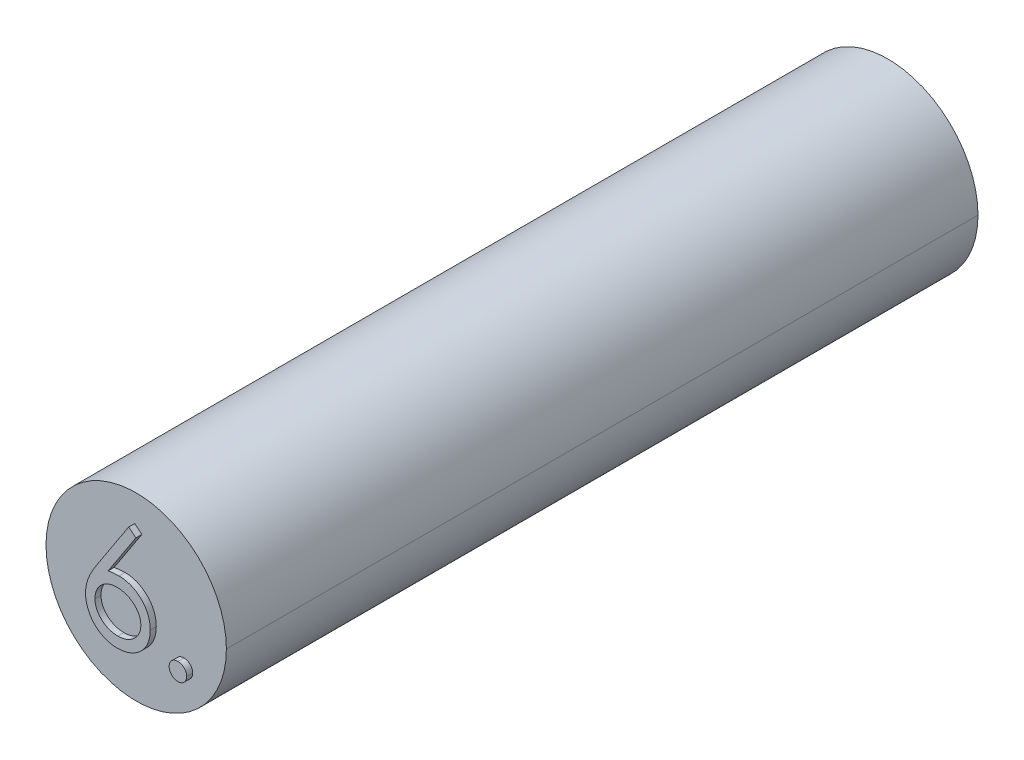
ISO-10303-21;
HEADER;
FILE_DESCRIPTION(('STEP AP214'),'2;1');
FILE_NAME('part.step','',(''),(''),'','','');
FILE_SCHEMA(('AUTOMOTIVE_DESIGN { 1 0 10303 214 1 1 1 1 }'));
ENDSEC;
DATA;
#1=APPLICATION_CONTEXT('core data for automotive mechanical design processes');
#2=APPLICATION_PROTOCOL_DEFINITION('international standard','automotive_design',2000,#1);
#3=PRODUCT_CONTEXT('',#1,'mechanical');
#4=PRODUCT('Part','Part','',(#3));
#5=PRODUCT_RELATED_PRODUCT_CATEGORY('part','',(#4));
#6=PRODUCT_DEFINITION_FORMATION('','',#4);
#7=PRODUCT_DEFINITION_CONTEXT('part definition',#1,'design');
#8=PRODUCT_DEFINITION('design','',#6,#7);
#9=PRODUCT_DEFINITION_SHAPE('','',#8);
#10=(LENGTH_UNIT() NAMED_UNIT(*) SI_UNIT(.MILLI.,.METRE.));
#11=(NAMED_UNIT(*) PLANE_ANGLE_UNIT() SI_UNIT($,.RADIAN.));
#12=(NAMED_UNIT(*) SI_UNIT($,.STERADIAN.) SOLID_ANGLE_UNIT());
#13=UNCERTAINTY_MEASURE_WITH_UNIT(LENGTH_MEASURE(1.E-05),#10,'distance_accuracy_value','');
#14=(GEOMETRIC_REPRESENTATION_CONTEXT(3) GLOBAL_UNCERTAINTY_ASSIGNED_CONTEXT((#13)) GLOBAL_UNIT_ASSIGNED_CONTEXT((#10,
#11,#12)) REPRESENTATION_CONTEXT('',''));
#15=CARTESIAN_POINT('',(0.,0.,0.));
#16=DIRECTION('',(0.,0.,1.));
#17=DIRECTION('',(1.,0.,0.));
#18=AXIS2_PLACEMENT_3D('',#15,#16,#17);
#19=CARTESIAN_POINT('',(1.38135416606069,-1.04671156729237,0.2));
#20=DIRECTION('',(0.,0.,1.));
#21=DIRECTION('',(1.,0.,0.));
#22=AXIS2_PLACEMENT_3D('',#19,#20,#21);
#23=PLANE('',#22);
#24=CARTESIAN_POINT('',(1.29615384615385,-1.25320512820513,0.2));
#25=CARTESIAN_POINT('',(1.29721594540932,-1.23345574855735,0.2));
#26=CARTESIAN_POINT('',(1.29928956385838,-1.19489750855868,0.2));
#27=CARTESIAN_POINT('',(1.31606522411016,-1.13969840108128,0.2));
#28=CARTESIAN_POINT('',(1.34344143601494,-1.08952996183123,0.2));
#29=CARTESIAN_POINT('',(1.38044683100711,-1.04513338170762,0.2));
#30=CARTESIAN_POINT('',(1.42497112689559,-1.0079460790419,0.2));
#31=CARTESIAN_POINT('',(1.47526733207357,-0.980881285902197,0.2));
#32=CARTESIAN_POINT('',(1.53030687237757,-0.964840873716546,0.2));
#33=CARTESIAN_POINT('',(1.56831681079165,-0.962658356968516,0.2));
#34=CARTESIAN_POINT('',(1.58782051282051,-0.961538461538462,0.2));
#35=(BOUNDED_CURVE() B_SPLINE_CURVE(3,(#24,#25,#26,#27,#28,#29,#30,#31,#32,#33,#34),
.UNSPECIFIED.,.F.,.F.) B_SPLINE_CURVE_WITH_KNOTS((4,1,1,1,1,1,1,1,4),(0.,0.129096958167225,
0.252045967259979,0.373904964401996,0.501037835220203,0.628170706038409,0.751376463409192,
0.872426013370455,1.),
.UNSPECIFIED.) CURVE() GEOMETRIC_REPRESENTATION_ITEM() RATIONAL_B_SPLINE_CURVE((1.,1.,1.,1.,1.,
1.,1.,1.,1.,1.,1.)) REPRESENTATION_ITEM(''));
#36=CARTESIAN_POINT('',(1.29615384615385,-1.25320512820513,0.2));
#37=VERTEX_POINT('',#36);
#38=CARTESIAN_POINT('',(1.58782051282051,-0.961538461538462,0.2));
#39=VERTEX_POINT('',#38);
#40=EDGE_CURVE('E346',#37,#39,#35,.T.);
#41=ORIENTED_EDGE('',*,*,#40,.F.);
#42=CARTESIAN_POINT('',(1.58782051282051,-1.5448717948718,0.2));
#43=CARTESIAN_POINT('',(1.56829460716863,-1.54382819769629,0.2));
#44=CARTESIAN_POINT('',(1.5301749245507,-1.54179082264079,0.2));
#45=CARTESIAN_POINT('',(1.47538893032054,-1.52462801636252,0.2));
#46=CARTESIAN_POINT('',(1.4249819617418,-1.4978045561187,0.2));
#47=CARTESIAN_POINT('',(1.38019425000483,-1.46053764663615,0.2));
#48=CARTESIAN_POINT('',(1.34365577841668,-1.41553750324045,0.2));
#49=CARTESIAN_POINT('',(1.3160303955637,-1.36533570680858,0.2));
#50=CARTESIAN_POINT('',(1.29944024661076,-1.31055426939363,0.2));
#51=CARTESIAN_POINT('',(1.2972583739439,-1.27247962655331,0.2));
#52=CARTESIAN_POINT('',(1.29615384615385,-1.25320512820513,0.2));
#53=(BOUNDED_CURVE() B_SPLINE_CURVE(3,(#42,#43,#44,#45,#46,#47,#48,#49,#50,#51,#52),
.UNSPECIFIED.,.F.,.F.) B_SPLINE_CURVE_WITH_KNOTS((4,1,1,1,1,1,1,1,4),(0.,0.12775660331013,
0.249414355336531,0.372796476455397,0.500111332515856,0.628609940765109,0.750643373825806,
0.873768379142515,1.),
.UNSPECIFIED.) CURVE() GEOMETRIC_REPRESENTATION_ITEM() RATIONAL_B_SPLINE_CURVE((1.,1.,1.,1.,1.,
1.,1.,1.,1.,1.,1.)) REPRESENTATION_ITEM(''));
#54=CARTESIAN_POINT('',(1.58782051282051,-1.5448717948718,0.2));
#55=VERTEX_POINT('',#54);
#56=EDGE_CURVE('E493',#55,#37,#53,.T.);
#57=ORIENTED_EDGE('',*,*,#56,.F.);
#58=CARTESIAN_POINT('',(1.87948717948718,-1.25320512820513,0.2));
#59=CARTESIAN_POINT('',(1.8782915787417,-1.27244845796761,0.2));
#60=CARTESIAN_POINT('',(1.8759338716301,-1.31039602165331,0.2));
#61=CARTESIAN_POINT('',(1.86067126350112,-1.36567748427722,0.2));
#62=CARTESIAN_POINT('',(1.83177321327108,-1.41530438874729,0.2));
#63=CARTESIAN_POINT('',(1.79553822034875,-1.46060652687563,0.2));
#64=CARTESIAN_POINT('',(1.75074178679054,-1.49754739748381,0.2));
#65=CARTESIAN_POINT('',(1.70063994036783,-1.52497074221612,0.2));
#66=CARTESIAN_POINT('',(1.64564868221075,-1.54166272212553,0.2));
#67=CARTESIAN_POINT('',(1.60733235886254,-1.54378901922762,0.2));
#68=CARTESIAN_POINT('',(1.58782051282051,-1.5448717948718,0.2));
#69=(BOUNDED_CURVE() B_SPLINE_CURVE(3,(#58,#59,#60,#61,#62,#63,#64,#65,#66,#67,#68),
.UNSPECIFIED.,.F.,.F.) B_SPLINE_CURVE_WITH_KNOTS((4,1,1,1,1,1,1,1,4),(0.,0.126177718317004,
0.248820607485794,0.371539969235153,0.499983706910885,0.627244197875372,0.749225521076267,
0.872297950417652,1.),
.UNSPECIFIED.) CURVE() GEOMETRIC_REPRESENTATION_ITEM() RATIONAL_B_SPLINE_CURVE((1.,1.,1.,1.,1.,
1.,1.,1.,1.,1.,1.)) REPRESENTATION_ITEM(''));
#70=CARTESIAN_POINT('',(1.87948717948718,-1.25320512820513,0.2));
#71=VERTEX_POINT('',#70);
#72=EDGE_CURVE('E25',#71,#55,#69,.T.);
#73=ORIENTED_EDGE('',*,*,#72,.F.);
#74=CARTESIAN_POINT('',(1.58782051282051,-0.961538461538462,0.2));
#75=CARTESIAN_POINT('',(1.60731072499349,-0.962696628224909,0.2));
#76=CARTESIAN_POINT('',(1.64551900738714,-0.964967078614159,0.2));
#77=CARTESIAN_POINT('',(1.70075813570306,-0.980543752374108,0.2));
#78=CARTESIAN_POINT('',(1.75075279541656,-1.00820241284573,0.2));
#79=CARTESIAN_POINT('',(1.79528504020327,-1.04506519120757,0.2));
#80=CARTESIAN_POINT('',(1.83199151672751,-1.08976085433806,0.2));
#81=CARTESIAN_POINT('',(1.86063586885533,-1.13935676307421,0.2));
#82=CARTESIAN_POINT('',(1.87607685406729,-1.19505835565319,0.2));
#83=CARTESIAN_POINT('',(1.87833076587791,-1.2334880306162,0.2));
#84=CARTESIAN_POINT('',(1.87948717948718,-1.25320512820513,0.2));
#85=(BOUNDED_CURVE() B_SPLINE_CURVE(3,(#74,#75,#76,#77,#78,#79,#80,#81,#82,#83,#84),
.UNSPECIFIED.,.F.,.F.) B_SPLINE_CURVE_WITH_KNOTS((4,1,1,1,1,1,1,1,4),(0.,0.127518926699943,
0.249985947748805,0.371792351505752,0.498870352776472,0.625948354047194,0.748491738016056,
0.870958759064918,1.),
.UNSPECIFIED.) CURVE() GEOMETRIC_REPRESENTATION_ITEM() RATIONAL_B_SPLINE_CURVE((1.,1.,1.,1.,1.,
1.,1.,1.,1.,1.,1.)) REPRESENTATION_ITEM(''));
#86=EDGE_CURVE('E9',#39,#71,#85,.T.);
#87=ORIENTED_EDGE('',*,*,#86,.F.);
#88=EDGE_LOOP('',(#41,#57,#73,#87));
#89=FACE_BOUND('',#88,.T.);
#90=ADVANCED_FACE('F15',(#89),#23,.T.);
#91=CARTESIAN_POINT('',(1.58782051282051,-0.961538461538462,0.2));
#92=CARTESIAN_POINT('',(1.58782051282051,-0.961538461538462,0.));
#93=CARTESIAN_POINT('',(1.60731072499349,-0.962696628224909,0.2));
#94=CARTESIAN_POINT('',(1.60731072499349,-0.962696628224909,0.));
#95=CARTESIAN_POINT('',(1.64551900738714,-0.964967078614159,0.2));
#96=CARTESIAN_POINT('',(1.64551900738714,-0.964967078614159,0.));
#97=CARTESIAN_POINT('',(1.70075813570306,-0.980543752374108,0.2));
#98=CARTESIAN_POINT('',(1.70075813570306,-0.980543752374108,0.));
#99=CARTESIAN_POINT('',(1.75075279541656,-1.00820241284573,0.2));
#100=CARTESIAN_POINT('',(1.75075279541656,-1.00820241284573,0.));
#101=CARTESIAN_POINT('',(1.79528504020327,-1.04506519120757,0.2));
#102=CARTESIAN_POINT('',(1.79528504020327,-1.04506519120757,0.));
#103=CARTESIAN_POINT('',(1.83199151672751,-1.08976085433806,0.2));
#104=CARTESIAN_POINT('',(1.83199151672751,-1.08976085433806,0.));
#105=CARTESIAN_POINT('',(1.86063586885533,-1.13935676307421,0.2));
#106=CARTESIAN_POINT('',(1.86063586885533,-1.13935676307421,0.));
#107=CARTESIAN_POINT('',(1.87607685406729,-1.19505835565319,0.2));
#108=CARTESIAN_POINT('',(1.87607685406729,-1.19505835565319,0.));
#109=CARTESIAN_POINT('',(1.87833076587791,-1.2334880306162,0.2));
#110=CARTESIAN_POINT('',(1.87833076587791,-1.2334880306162,0.));
#111=CARTESIAN_POINT('',(1.87948717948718,-1.25320512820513,0.2));
#112=CARTESIAN_POINT('',(1.87948717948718,-1.25320512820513,0.));
#113=(BOUNDED_SURFACE() B_SPLINE_SURFACE(3,1,((#91,#92),(#93,#94),(#95,#96),(#97,#98),(#99,
#100),(#101,#102),(#103,#104),(#105,#106),(#107,#108),(#109,#110),(#111,#112)),.UNSPECIFIED.,
.F.,.F.,.F.) B_SPLINE_SURFACE_WITH_KNOTS((4,1,1,1,1,1,1,1,4),(2,2),(0.,0.127518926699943,
0.249985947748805,0.371792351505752,0.498870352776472,0.625948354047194,0.748491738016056,
0.870958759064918,1.),(0.,1.),
.UNSPECIFIED.) GEOMETRIC_REPRESENTATION_ITEM() RATIONAL_B_SPLINE_SURFACE(((1.,1.),(1.,1.),(1.,
1.),(1.,1.),(1.,1.),(1.,1.),(1.,1.),(1.,1.),(1.,1.),(1.,1.),(1.,1.))) REPRESENTATION_ITEM('') SURFACE());
#114=CARTESIAN_POINT('',(1.58782051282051,-0.961538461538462,0.));
#115=CARTESIAN_POINT('',(1.60731072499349,-0.962696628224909,0.));
#116=CARTESIAN_POINT('',(1.64551900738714,-0.964967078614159,0.));
#117=CARTESIAN_POINT('',(1.70075813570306,-0.980543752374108,0.));
#118=CARTESIAN_POINT('',(1.75075279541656,-1.00820241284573,0.));
#119=CARTESIAN_POINT('',(1.79528504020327,-1.04506519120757,0.));
#120=CARTESIAN_POINT('',(1.83199151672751,-1.08976085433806,0.));
#121=CARTESIAN_POINT('',(1.86063586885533,-1.13935676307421,0.));
#122=CARTESIAN_POINT('',(1.87607685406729,-1.19505835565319,0.));
#123=CARTESIAN_POINT('',(1.87833076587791,-1.2334880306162,0.));
#124=CARTESIAN_POINT('',(1.87948717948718,-1.25320512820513,0.));
#125=(BOUNDED_CURVE() B_SPLINE_CURVE(3,(#114,#115,#116,#117,#118,#119,#120,#121,#122,#123,#124),
.UNSPECIFIED.,.F.,.F.) B_SPLINE_CURVE_WITH_KNOTS((4,1,1,1,1,1,1,1,4),(0.,0.127518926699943,
0.249985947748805,0.371792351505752,0.498870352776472,0.625948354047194,0.748491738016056,
0.870958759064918,1.),
.UNSPECIFIED.) CURVE() GEOMETRIC_REPRESENTATION_ITEM() RATIONAL_B_SPLINE_CURVE((1.,1.,1.,1.,1.,
1.,1.,1.,1.,1.,1.)) REPRESENTATION_ITEM(''));
#126=CARTESIAN_POINT('',(1.58782051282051,-0.961538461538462,0.));
#127=VERTEX_POINT('',#126);
#128=CARTESIAN_POINT('',(1.87948717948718,-1.25320512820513,0.));
#129=VERTEX_POINT('',#128);
#130=EDGE_CURVE('E259',#127,#129,#125,.T.);
#131=DIRECTION('',(0.,0.,-1.));
#132=VECTOR('',#131,1.);
#133=CARTESIAN_POINT('',(1.58782051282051,-0.961538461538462,0.2));
#134=LINE('',#133,#132);
#135=EDGE_CURVE('E352',#39,#127,#134,.T.);
#136=DIRECTION('',(0.,0.,-1.));
#137=VECTOR('',#136,1.);
#138=CARTESIAN_POINT('',(1.87948717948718,-1.25320512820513,0.2));
#139=LINE('',#138,#137);
#140=EDGE_CURVE('E498',#71,#129,#139,.T.);
#141=ORIENTED_EDGE('',*,*,#130,.F.);
#142=ORIENTED_EDGE('',*,*,#135,.F.);
#143=ORIENTED_EDGE('',*,*,#86,.T.);
#144=ORIENTED_EDGE('',*,*,#140,.T.);
#145=EDGE_LOOP('',(#141,#142,#143,#144));
#146=FACE_BOUND('',#145,.T.);
#147=ADVANCED_FACE('F715',(#146),#113,.T.);
#148=CARTESIAN_POINT('',(1.87948717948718,-1.25320512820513,0.2));
#149=CARTESIAN_POINT('',(1.87948717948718,-1.25320512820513,0.));
#150=CARTESIAN_POINT('',(1.8782915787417,-1.27244845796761,0.2));
#151=CARTESIAN_POINT('',(1.8782915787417,-1.27244845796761,0.));
#152=CARTESIAN_POINT('',(1.8759338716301,-1.31039602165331,0.2));
#153=CARTESIAN_POINT('',(1.8759338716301,-1.31039602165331,0.));
#154=CARTESIAN_POINT('',(1.86067126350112,-1.36567748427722,0.2));
#155=CARTESIAN_POINT('',(1.86067126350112,-1.36567748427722,0.));
#156=CARTESIAN_POINT('',(1.83177321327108,-1.41530438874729,0.2));
#157=CARTESIAN_POINT('',(1.83177321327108,-1.41530438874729,0.));
#158=CARTESIAN_POINT('',(1.79553822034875,-1.46060652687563,0.2));
#159=CARTESIAN_POINT('',(1.79553822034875,-1.46060652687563,0.));
#160=CARTESIAN_POINT('',(1.75074178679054,-1.49754739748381,0.2));
#161=CARTESIAN_POINT('',(1.75074178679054,-1.49754739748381,0.));
#162=CARTESIAN_POINT('',(1.70063994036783,-1.52497074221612,0.2));
#163=CARTESIAN_POINT('',(1.70063994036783,-1.52497074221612,0.));
#164=CARTESIAN_POINT('',(1.64564868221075,-1.54166272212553,0.2));
#165=CARTESIAN_POINT('',(1.64564868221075,-1.54166272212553,0.));
#166=CARTESIAN_POINT('',(1.60733235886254,-1.54378901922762,0.2));
#167=CARTESIAN_POINT('',(1.60733235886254,-1.54378901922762,0.));
#168=CARTESIAN_POINT('',(1.58782051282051,-1.5448717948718,0.2));
#169=CARTESIAN_POINT('',(1.58782051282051,-1.5448717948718,0.));
#170=(BOUNDED_SURFACE() B_SPLINE_SURFACE(3,1,((#148,#149),(#150,#151),(#152,#153),(#154,#155),
(#156,#157),(#158,#159),(#160,#161),(#162,#163),(#164,#165),(#166,#167),(#168,#169)),
.UNSPECIFIED.,.F.,.F.,.F.) B_SPLINE_SURFACE_WITH_KNOTS((4,1,1,1,1,1,1,1,4),(2,2),(0.,
0.126177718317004,0.248820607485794,0.371539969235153,0.499983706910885,0.627244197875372,
0.749225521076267,0.872297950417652,1.),(0.,1.),
.UNSPECIFIED.) GEOMETRIC_REPRESENTATION_ITEM() RATIONAL_B_SPLINE_SURFACE(((1.,1.),(1.,1.),(1.,
1.),(1.,1.),(1.,1.),(1.,1.),(1.,1.),(1.,1.),(1.,1.),(1.,1.),(1.,1.))) REPRESENTATION_ITEM('') SURFACE());
#171=CARTESIAN_POINT('',(1.87948717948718,-1.25320512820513,0.));
#172=CARTESIAN_POINT('',(1.8782915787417,-1.27244845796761,0.));
#173=CARTESIAN_POINT('',(1.8759338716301,-1.31039602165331,0.));
#174=CARTESIAN_POINT('',(1.86067126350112,-1.36567748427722,0.));
#175=CARTESIAN_POINT('',(1.83177321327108,-1.41530438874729,0.));
#176=CARTESIAN_POINT('',(1.79553822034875,-1.46060652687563,0.));
#177=CARTESIAN_POINT('',(1.75074178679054,-1.49754739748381,0.));
#178=CARTESIAN_POINT('',(1.70063994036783,-1.52497074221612,0.));
#179=CARTESIAN_POINT('',(1.64564868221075,-1.54166272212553,0.));
#180=CARTESIAN_POINT('',(1.60733235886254,-1.54378901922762,0.));
#181=CARTESIAN_POINT('',(1.58782051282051,-1.5448717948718,0.));
#182=(BOUNDED_CURVE() B_SPLINE_CURVE(3,(#171,#172,#173,#174,#175,#176,#177,#178,#179,#180,#181),
.UNSPECIFIED.,.F.,.F.) B_SPLINE_CURVE_WITH_KNOTS((4,1,1,1,1,1,1,1,4),(0.,0.126177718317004,
0.248820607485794,0.371539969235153,0.499983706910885,0.627244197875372,0.749225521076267,
0.872297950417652,1.),
.UNSPECIFIED.) CURVE() GEOMETRIC_REPRESENTATION_ITEM() RATIONAL_B_SPLINE_CURVE((1.,1.,1.,1.,1.,
1.,1.,1.,1.,1.,1.)) REPRESENTATION_ITEM(''));
#183=CARTESIAN_POINT('',(1.58782051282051,-1.5448717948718,0.));
#184=VERTEX_POINT('',#183);
#185=EDGE_CURVE('E268',#129,#184,#182,.T.);
#186=DIRECTION('',(0.,0.,-1.));
#187=VECTOR('',#186,1.);
#188=CARTESIAN_POINT('',(1.58782051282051,-1.5448717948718,0.2));
#189=LINE('',#188,#187);
#190=EDGE_CURVE('E366',#55,#184,#189,.T.);
#191=ORIENTED_EDGE('',*,*,#185,.F.);
#192=ORIENTED_EDGE('',*,*,#140,.F.);
#193=ORIENTED_EDGE('',*,*,#72,.T.);
#194=ORIENTED_EDGE('',*,*,#190,.T.);
#195=EDGE_LOOP('',(#191,#192,#193,#194));
#196=FACE_BOUND('',#195,.T.);
#197=ADVANCED_FACE('F705',(#196),#170,.T.);
#198=CARTESIAN_POINT('',(1.58782051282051,-1.5448717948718,0.2));
#199=CARTESIAN_POINT('',(1.58782051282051,-1.5448717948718,0.));
#200=CARTESIAN_POINT('',(1.56829460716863,-1.54382819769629,0.2));
#201=CARTESIAN_POINT('',(1.56829460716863,-1.54382819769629,0.));
#202=CARTESIAN_POINT('',(1.5301749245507,-1.54179082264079,0.2));
#203=CARTESIAN_POINT('',(1.5301749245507,-1.54179082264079,0.));
#204=CARTESIAN_POINT('',(1.47538893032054,-1.52462801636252,0.2));
#205=CARTESIAN_POINT('',(1.47538893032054,-1.52462801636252,0.));
#206=CARTESIAN_POINT('',(1.4249819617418,-1.4978045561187,0.2));
#207=CARTESIAN_POINT('',(1.4249819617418,-1.4978045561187,0.));
#208=CARTESIAN_POINT('',(1.38019425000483,-1.46053764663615,0.2));
#209=CARTESIAN_POINT('',(1.38019425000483,-1.46053764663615,0.));
#210=CARTESIAN_POINT('',(1.34365577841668,-1.41553750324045,0.2));
#211=CARTESIAN_POINT('',(1.34365577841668,-1.41553750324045,0.));
#212=CARTESIAN_POINT('',(1.3160303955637,-1.36533570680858,0.2));
#213=CARTESIAN_POINT('',(1.3160303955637,-1.36533570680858,0.));
#214=CARTESIAN_POINT('',(1.29944024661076,-1.31055426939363,0.2));
#215=CARTESIAN_POINT('',(1.29944024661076,-1.31055426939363,0.));
#216=CARTESIAN_POINT('',(1.2972583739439,-1.27247962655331,0.2));
#217=CARTESIAN_POINT('',(1.2972583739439,-1.27247962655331,0.));
#218=CARTESIAN_POINT('',(1.29615384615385,-1.25320512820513,0.2));
#219=CARTESIAN_POINT('',(1.29615384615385,-1.25320512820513,0.));
#220=(BOUNDED_SURFACE() B_SPLINE_SURFACE(3,1,((#198,#199),(#200,#201),(#202,#203),(#204,#205),
(#206,#207),(#208,#209),(#210,#211),(#212,#213),(#214,#215),(#216,#217),(#218,#219)),
.UNSPECIFIED.,.F.,.F.,.F.) B_SPLINE_SURFACE_WITH_KNOTS((4,1,1,1,1,1,1,1,4),(2,2),(0.,
0.12775660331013,0.249414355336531,0.372796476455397,0.500111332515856,0.628609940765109,
0.750643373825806,0.873768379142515,1.),(0.,1.),
.UNSPECIFIED.) GEOMETRIC_REPRESENTATION_ITEM() RATIONAL_B_SPLINE_SURFACE(((1.,1.),(1.,1.),(1.,
1.),(1.,1.),(1.,1.),(1.,1.),(1.,1.),(1.,1.),(1.,1.),(1.,1.),(1.,1.))) REPRESENTATION_ITEM('') SURFACE());
#221=CARTESIAN_POINT('',(1.58782051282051,-1.5448717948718,0.));
#222=CARTESIAN_POINT('',(1.56829460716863,-1.54382819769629,0.));
#223=CARTESIAN_POINT('',(1.5301749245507,-1.54179082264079,0.));
#224=CARTESIAN_POINT('',(1.47538893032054,-1.52462801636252,0.));
#225=CARTESIAN_POINT('',(1.4249819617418,-1.4978045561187,0.));
#226=CARTESIAN_POINT('',(1.38019425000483,-1.46053764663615,0.));
#227=CARTESIAN_POINT('',(1.34365577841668,-1.41553750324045,0.));
#228=CARTESIAN_POINT('',(1.3160303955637,-1.36533570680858,0.));
#229=CARTESIAN_POINT('',(1.29944024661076,-1.31055426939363,0.));
#230=CARTESIAN_POINT('',(1.2972583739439,-1.27247962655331,0.));
#231=CARTESIAN_POINT('',(1.29615384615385,-1.25320512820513,0.));
#232=(BOUNDED_CURVE() B_SPLINE_CURVE(3,(#221,#222,#223,#224,#225,#226,#227,#228,#229,#230,#231),
.UNSPECIFIED.,.F.,.F.) B_SPLINE_CURVE_WITH_KNOTS((4,1,1,1,1,1,1,1,4),(0.,0.12775660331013,
0.249414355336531,0.372796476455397,0.500111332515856,0.628609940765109,0.750643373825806,
0.873768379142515,1.),
.UNSPECIFIED.) CURVE() GEOMETRIC_REPRESENTATION_ITEM() RATIONAL_B_SPLINE_CURVE((1.,1.,1.,1.,1.,
1.,1.,1.,1.,1.,1.)) REPRESENTATION_ITEM(''));
#233=CARTESIAN_POINT('',(1.29615384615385,-1.25320512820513,0.));
#234=VERTEX_POINT('',#233);
#235=EDGE_CURVE('E282',#184,#234,#232,.T.);
#236=DIRECTION('',(0.,0.,-1.));
#237=VECTOR('',#236,1.);
#238=CARTESIAN_POINT('',(1.29615384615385,-1.25320512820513,0.2));
#239=LINE('',#238,#237);
#240=EDGE_CURVE('E353',#37,#234,#239,.T.);
#241=ORIENTED_EDGE('',*,*,#235,.F.);
#242=ORIENTED_EDGE('',*,*,#190,.F.);
#243=ORIENTED_EDGE('',*,*,#56,.T.);
#244=ORIENTED_EDGE('',*,*,#240,.T.);
#245=EDGE_LOOP('',(#241,#242,#243,#244));
#246=FACE_BOUND('',#245,.T.);
#247=ADVANCED_FACE('F695',(#246),#220,.T.);
#248=CARTESIAN_POINT('',(1.29615384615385,-1.25320512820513,0.2));
#249=CARTESIAN_POINT('',(1.29615384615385,-1.25320512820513,0.));
#250=CARTESIAN_POINT('',(1.29721594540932,-1.23345574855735,0.2));
#251=CARTESIAN_POINT('',(1.29721594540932,-1.23345574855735,0.));
#252=CARTESIAN_POINT('',(1.29928956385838,-1.19489750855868,0.2));
#253=CARTESIAN_POINT('',(1.29928956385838,-1.19489750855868,0.));
#254=CARTESIAN_POINT('',(1.31606522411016,-1.13969840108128,0.2));
#255=CARTESIAN_POINT('',(1.31606522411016,-1.13969840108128,0.));
#256=CARTESIAN_POINT('',(1.34344143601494,-1.08952996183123,0.2));
#257=CARTESIAN_POINT('',(1.34344143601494,-1.08952996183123,0.));
#258=CARTESIAN_POINT('',(1.38044683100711,-1.04513338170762,0.2));
#259=CARTESIAN_POINT('',(1.38044683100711,-1.04513338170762,0.));
#260=CARTESIAN_POINT('',(1.42497112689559,-1.0079460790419,0.2));
#261=CARTESIAN_POINT('',(1.42497112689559,-1.0079460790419,0.));
#262=CARTESIAN_POINT('',(1.47526733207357,-0.980881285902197,0.2));
#263=CARTESIAN_POINT('',(1.47526733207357,-0.980881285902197,0.));
#264=CARTESIAN_POINT('',(1.53030687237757,-0.964840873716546,0.2));
#265=CARTESIAN_POINT('',(1.53030687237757,-0.964840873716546,0.));
#266=CARTESIAN_POINT('',(1.56831681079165,-0.962658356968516,0.2));
#267=CARTESIAN_POINT('',(1.56831681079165,-0.962658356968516,0.));
#268=CARTESIAN_POINT('',(1.58782051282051,-0.961538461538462,0.2));
#269=CARTESIAN_POINT('',(1.58782051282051,-0.961538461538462,0.));
#270=(BOUNDED_SURFACE() B_SPLINE_SURFACE(3,1,((#248,#249),(#250,#251),(#252,#253),(#254,#255),
(#256,#257),(#258,#259),(#260,#261),(#262,#263),(#264,#265),(#266,#267),(#268,#269)),
.UNSPECIFIED.,.F.,.F.,.F.) B_SPLINE_SURFACE_WITH_KNOTS((4,1,1,1,1,1,1,1,4),(2,2),(0.,
0.129096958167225,0.252045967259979,0.373904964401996,0.501037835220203,0.628170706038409,
0.751376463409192,0.872426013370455,1.),(0.,1.),
.UNSPECIFIED.) GEOMETRIC_REPRESENTATION_ITEM() RATIONAL_B_SPLINE_SURFACE(((1.,1.),(1.,1.),(1.,
1.),(1.,1.),(1.,1.),(1.,1.),(1.,1.),(1.,1.),(1.,1.),(1.,1.),(1.,1.))) REPRESENTATION_ITEM('') SURFACE());
#271=CARTESIAN_POINT('',(1.29615384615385,-1.25320512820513,0.));
#272=CARTESIAN_POINT('',(1.29721594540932,-1.23345574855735,0.));
#273=CARTESIAN_POINT('',(1.29928956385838,-1.19489750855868,0.));
#274=CARTESIAN_POINT('',(1.31606522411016,-1.13969840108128,0.));
#275=CARTESIAN_POINT('',(1.34344143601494,-1.08952996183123,0.));
#276=CARTESIAN_POINT('',(1.38044683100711,-1.04513338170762,0.));
#277=CARTESIAN_POINT('',(1.42497112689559,-1.0079460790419,0.));
#278=CARTESIAN_POINT('',(1.47526733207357,-0.980881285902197,0.));
#279=CARTESIAN_POINT('',(1.53030687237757,-0.964840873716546,0.));
#280=CARTESIAN_POINT('',(1.56831681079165,-0.962658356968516,0.));
#281=CARTESIAN_POINT('',(1.58782051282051,-0.961538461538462,0.));
#282=(BOUNDED_CURVE() B_SPLINE_CURVE(3,(#271,#272,#273,#274,#275,#276,#277,#278,#279,#280,#281),
.UNSPECIFIED.,.F.,.F.) B_SPLINE_CURVE_WITH_KNOTS((4,1,1,1,1,1,1,1,4),(0.,0.129096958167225,
0.252045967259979,0.373904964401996,0.501037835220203,0.628170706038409,0.751376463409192,
0.872426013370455,1.),
.UNSPECIFIED.) CURVE() GEOMETRIC_REPRESENTATION_ITEM() RATIONAL_B_SPLINE_CURVE((1.,1.,1.,1.,1.,
1.,1.,1.,1.,1.,1.)) REPRESENTATION_ITEM(''));
#283=EDGE_CURVE('E253',#234,#127,#282,.T.);
#284=ORIENTED_EDGE('',*,*,#283,.F.);
#285=ORIENTED_EDGE('',*,*,#240,.F.);
#286=ORIENTED_EDGE('',*,*,#40,.T.);
#287=ORIENTED_EDGE('',*,*,#135,.T.);
#288=EDGE_LOOP('',(#284,#285,#286,#287));
#289=FACE_BOUND('',#288,.T.);
#290=ADVANCED_FACE('F685',(#289),#270,.T.);
#291=CARTESIAN_POINT('',(0.,0.,0.));
#292=DIRECTION('',(0.,0.,1.));
#293=DIRECTION('',(1.,0.,0.));
#294=AXIS2_PLACEMENT_3D('',#291,#292,#293);
#295=PLANE('',#294);
#296=CARTESIAN_POINT('',(0.353846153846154,-0.536658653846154,0.));
#297=CARTESIAN_POINT('',(0.35329586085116,-0.512764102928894,0.));
#298=CARTESIAN_POINT('',(0.352215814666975,-0.465866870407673,0.));
#299=CARTESIAN_POINT('',(0.339999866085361,-0.397179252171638,0.));
#300=CARTESIAN_POINT('',(0.323057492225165,-0.330854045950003,0.));
#301=CARTESIAN_POINT('',(0.29747446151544,-0.267308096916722,0.));
#302=CARTESIAN_POINT('',(0.264237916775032,-0.20679216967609,0.));
#303=CARTESIAN_POINT('',(0.223754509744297,-0.149000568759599,0.));
#304=CARTESIAN_POINT('',(0.176921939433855,-0.0934902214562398,0.));
#305=CARTESIAN_POINT('',(0.12282439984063,-0.0419274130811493,0.));
#306=CARTESIAN_POINT('',(0.0639341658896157,0.00521966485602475,0.));
#307=CARTESIAN_POINT('',(0.00131858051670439,0.0468392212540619,0.));
#308=CARTESIAN_POINT('',(-0.0641893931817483,0.0819641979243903,0.));
#309=CARTESIAN_POINT('',(-0.132523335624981,0.111271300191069,0.));
#310=CARTESIAN_POINT('',(-0.204466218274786,0.13242077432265,0.));
#311=CARTESIAN_POINT('',(-0.278856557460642,0.149074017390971,0.));
#312=CARTESIAN_POINT('',(-0.356645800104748,0.1579360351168,0.));
#313=CARTESIAN_POINT('',(-0.409422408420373,0.159473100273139,0.));
#314=CARTESIAN_POINT('',(-0.436318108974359,0.16025641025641,0.));
#315=(BOUNDED_CURVE() B_SPLINE_CURVE(3,(#296,#297,#298,#299,#300,#301,#302,#303,#304,#305,#306,
#307,#308,#309,#310,#311,#312,#313,#314),.UNSPECIFIED.,.F.,.F.) B_SPLINE_CURVE_WITH_KNOTS((4,1,
1,1,1,1,1,1,1,1,1,1,1,1,1,1,4),(0.,0.0611379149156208,0.119993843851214,0.178225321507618,
0.236256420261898,0.29492937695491,0.354715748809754,0.416729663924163,0.480664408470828,
0.545831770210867,0.609758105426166,0.672971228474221,0.736016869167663,0.799839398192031,
0.864775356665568,0.931087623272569,1.),
.UNSPECIFIED.) CURVE() GEOMETRIC_REPRESENTATION_ITEM() RATIONAL_B_SPLINE_CURVE((1.,1.,1.,1.,1.,
1.,1.,1.,1.,1.,1.,1.,1.,1.,1.,1.,1.,1.,1.)) REPRESENTATION_ITEM(''));
#316=CARTESIAN_POINT('',(0.353846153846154,-0.536658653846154,0.));
#317=VERTEX_POINT('',#316);
#318=CARTESIAN_POINT('',(-0.436318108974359,0.16025641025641,0.));
#319=VERTEX_POINT('',#318);
#320=EDGE_CURVE('E227',#317,#319,#315,.T.);
#321=ORIENTED_EDGE('',*,*,#320,.T.);
#322=CARTESIAN_POINT('',(-0.436318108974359,0.16025641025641,0.));
#323=CARTESIAN_POINT('',(-0.462980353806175,0.159478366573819,0.));
#324=CARTESIAN_POINT('',(-0.515059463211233,0.157958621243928,0.));
#325=CARTESIAN_POINT('',(-0.591466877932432,0.149133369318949,0.));
#326=CARTESIAN_POINT('',(-0.66378012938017,0.132514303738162,0.));
#327=CARTESIAN_POINT('',(-0.732957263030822,0.111347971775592,0.));
#328=CARTESIAN_POINT('',(-0.797704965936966,0.082244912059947,0.));
#329=CARTESIAN_POINT('',(-0.858493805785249,0.046893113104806,0.));
#330=CARTESIAN_POINT('',(-0.915558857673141,0.00527193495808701,0.));
#331=CARTESIAN_POINT('',(-0.968302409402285,-0.0420289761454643,0.));
#332=CARTESIAN_POINT('',(-1.01612207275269,-0.0938170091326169,0.));
#333=CARTESIAN_POINT('',(-1.05730320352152,-0.149286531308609,0.));
#334=CARTESIAN_POINT('',(-1.0928256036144,-0.207100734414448,0.));
#335=CARTESIAN_POINT('',(-1.1217074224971,-0.267742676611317,0.));
#336=CARTESIAN_POINT('',(-1.14419749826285,-0.331189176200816,0.));
#337=CARTESIAN_POINT('',(-1.1604657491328,-0.397148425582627,0.));
#338=CARTESIAN_POINT('',(-1.16951950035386,-0.466062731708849,0.));
#339=CARTESIAN_POINT('',(-1.17102573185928,-0.512795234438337,0.));
#340=CARTESIAN_POINT('',(-1.17179487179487,-0.536658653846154,0.));
#341=(BOUNDED_CURVE() B_SPLINE_CURVE(3,(#322,#323,#324,#325,#326,#327,#328,#329,#330,#331,#332,
#333,#334,#335,#336,#337,#338,#339,#340),.UNSPECIFIED.,.F.,.F.) B_SPLINE_CURVE_WITH_KNOTS((4,1,
1,1,1,1,1,1,1,1,1,1,1,1,1,1,4),(0.,0.070599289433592,0.13790092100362,0.203196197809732,
0.266789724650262,0.329106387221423,0.390653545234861,0.452653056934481,0.515748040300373,
0.577926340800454,0.638930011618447,0.698350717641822,0.757296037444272,0.816393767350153,
0.876266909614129,0.936817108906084,1.),
.UNSPECIFIED.) CURVE() GEOMETRIC_REPRESENTATION_ITEM() RATIONAL_B_SPLINE_CURVE((1.,1.,1.,1.,1.,
1.,1.,1.,1.,1.,1.,1.,1.,1.,1.,1.,1.,1.,1.)) REPRESENTATION_ITEM(''));
#342=CARTESIAN_POINT('',(-1.17179487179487,-0.536658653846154,0.));
#343=VERTEX_POINT('',#342);
#344=EDGE_CURVE('E301',#319,#343,#341,.T.);
#345=ORIENTED_EDGE('',*,*,#344,.T.);
#346=CARTESIAN_POINT('',(-1.17179487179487,-0.536658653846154,0.));
#347=CARTESIAN_POINT('',(-1.17116851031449,-0.560308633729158,0.));
#348=CARTESIAN_POINT('',(-1.16994030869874,-0.606682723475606,0.));
#349=CARTESIAN_POINT('',(-1.15878798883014,-0.675021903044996,0.));
#350=CARTESIAN_POINT('',(-1.14175290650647,-0.740786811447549,0.));
#351=CARTESIAN_POINT('',(-1.11641251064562,-0.803638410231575,0.));
#352=CARTESIAN_POINT('',(-1.08618562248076,-0.86453472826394,0.));
#353=CARTESIAN_POINT('',(-1.04628029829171,-0.921270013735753,0.));
#354=CARTESIAN_POINT('',(-1.0020635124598,-0.977290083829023,0.));
#355=CARTESIAN_POINT('',(-0.949209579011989,-1.02829155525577,0.));
#356=CARTESIAN_POINT('',(-0.892486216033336,-1.07574817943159,0.));
#357=CARTESIAN_POINT('',(-0.831885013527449,-1.11722843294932,0.));
#358=CARTESIAN_POINT('',(-0.768725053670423,-1.15271460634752,0.));
#359=CARTESIAN_POINT('',(-0.702153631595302,-1.18052570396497,0.));
#360=CARTESIAN_POINT('',(-0.633115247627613,-1.20334999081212,0.));
#361=CARTESIAN_POINT('',(-0.561034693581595,-1.21941147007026,0.));
#362=CARTESIAN_POINT('',(-0.485861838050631,-1.22849199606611,0.));
#363=CARTESIAN_POINT('',(-0.434939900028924,-1.23000018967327,0.));
#364=CARTESIAN_POINT('',(-0.408974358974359,-1.23076923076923,0.));
#365=(BOUNDED_CURVE() B_SPLINE_CURVE(3,(#346,#347,#348,#349,#350,#351,#352,#353,#354,#355,#356,
#357,#358,#359,#360,#361,#362,#363,#364),.UNSPECIFIED.,.F.,.F.) B_SPLINE_CURVE_WITH_KNOTS((4,1,
1,1,1,1,1,1,1,1,1,1,1,1,1,1,4),(0.,0.0618417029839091,0.121262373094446,0.180745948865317,
0.239230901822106,0.298307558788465,0.358182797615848,0.420359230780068,0.484792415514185,
0.549938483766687,0.613718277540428,0.676680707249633,0.739154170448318,0.802199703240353,
0.866740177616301,0.932049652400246,1.),
.UNSPECIFIED.) CURVE() GEOMETRIC_REPRESENTATION_ITEM() RATIONAL_B_SPLINE_CURVE((1.,1.,1.,1.,1.,
1.,1.,1.,1.,1.,1.,1.,1.,1.,1.,1.,1.,1.,1.)) REPRESENTATION_ITEM(''));
#366=CARTESIAN_POINT('',(-0.408974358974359,-1.23076923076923,0.));
#367=VERTEX_POINT('',#366);
#368=EDGE_CURVE('E300',#343,#367,#365,.T.);
#369=ORIENTED_EDGE('',*,*,#368,.T.);
#370=CARTESIAN_POINT('',(-0.408974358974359,-1.23076923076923,0.));
#371=CARTESIAN_POINT('',(-0.38300886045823,-1.23000012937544,0.));
#372=CARTESIAN_POINT('',(-0.332087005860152,-1.22849181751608,0.));
#373=CARTESIAN_POINT('',(-0.256913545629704,-1.219412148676,0.));
#374=CARTESIAN_POINT('',(-0.184835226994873,-1.20334750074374,0.));
#375=CARTESIAN_POINT('',(-0.115788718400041,-1.18053473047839,0.));
#376=CARTESIAN_POINT('',(-0.0492472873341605,-1.15268112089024,0.));
#377=CARTESIAN_POINT('',(0.0138574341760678,-1.11744920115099,0.));
#378=CARTESIAN_POINT('',(0.0738855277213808,-1.07549308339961,0.));
#379=CARTESIAN_POINT('',(0.130646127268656,-1.02837265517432,0.));
#380=CARTESIAN_POINT('',(0.183280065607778,-0.976999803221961,0.));
#381=CARTESIAN_POINT('',(0.22855734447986,-0.921770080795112,0.));
#382=CARTESIAN_POINT('',(0.267240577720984,-0.8640761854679,0.));
#383=CARTESIAN_POINT('',(0.298674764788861,-0.803878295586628,0.));
#384=CARTESIAN_POINT('',(0.323736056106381,-0.740748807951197,0.));
#385=CARTESIAN_POINT('',(0.340857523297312,-0.675032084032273,0.));
#386=CARTESIAN_POINT('',(0.351986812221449,-0.606680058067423,0.));
#387=CARTESIAN_POINT('',(0.353218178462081,-0.560307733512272,0.));
#388=CARTESIAN_POINT('',(0.353846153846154,-0.536658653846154,0.));
#389=(BOUNDED_CURVE() B_SPLINE_CURVE(3,(#370,#371,#372,#373,#374,#375,#376,#377,#378,#379,#380,
#381,#382,#383,#384,#385,#386,#387,#388),.UNSPECIFIED.,.F.,.F.) B_SPLINE_CURVE_WITH_KNOTS((4,1,
1,1,1,1,1,1,1,1,1,1,1,1,1,1,4),(0.,0.0679623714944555,0.133283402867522,0.197835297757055,
0.260891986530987,0.323376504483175,0.386350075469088,0.449637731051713,0.514795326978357,
0.579239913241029,0.641814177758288,0.701358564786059,0.76072676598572,0.819222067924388,
0.87871616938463,0.938147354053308,1.),
.UNSPECIFIED.) CURVE() GEOMETRIC_REPRESENTATION_ITEM() RATIONAL_B_SPLINE_CURVE((1.,1.,1.,1.,1.,
1.,1.,1.,1.,1.,1.,1.,1.,1.,1.,1.,1.,1.,1.)) REPRESENTATION_ITEM(''));
#390=EDGE_CURVE('E481',#367,#317,#389,.T.);
#391=ORIENTED_EDGE('',*,*,#390,.T.);
#392=EDGE_LOOP('',(#321,#345,#369,#391));
#393=FACE_BOUND('',#392,.T.);
#394=ADVANCED_FACE('F675',(#393),#295,.T.);
#395=CARTESIAN_POINT('',(-0.408974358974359,-1.23076923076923,0.2));
#396=CARTESIAN_POINT('',(-0.408974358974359,-1.23076923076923,0.));
#397=CARTESIAN_POINT('',(-0.38300886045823,-1.23000012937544,0.2));
#398=CARTESIAN_POINT('',(-0.38300886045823,-1.23000012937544,0.));
#399=CARTESIAN_POINT('',(-0.332087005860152,-1.22849181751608,0.2));
#400=CARTESIAN_POINT('',(-0.332087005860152,-1.22849181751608,0.));
#401=CARTESIAN_POINT('',(-0.256913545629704,-1.219412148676,0.2));
#402=CARTESIAN_POINT('',(-0.256913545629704,-1.219412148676,0.));
#403=CARTESIAN_POINT('',(-0.184835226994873,-1.20334750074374,0.2));
#404=CARTESIAN_POINT('',(-0.184835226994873,-1.20334750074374,0.));
#405=CARTESIAN_POINT('',(-0.115788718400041,-1.18053473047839,0.2));
#406=CARTESIAN_POINT('',(-0.115788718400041,-1.18053473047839,0.));
#407=CARTESIAN_POINT('',(-0.0492472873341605,-1.15268112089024,0.2));
#408=CARTESIAN_POINT('',(-0.0492472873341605,-1.15268112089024,0.));
#409=CARTESIAN_POINT('',(0.0138574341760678,-1.11744920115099,0.2));
#410=CARTESIAN_POINT('',(0.0138574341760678,-1.11744920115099,0.));
#411=CARTESIAN_POINT('',(0.0738855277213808,-1.07549308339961,0.2));
#412=CARTESIAN_POINT('',(0.0738855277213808,-1.07549308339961,0.));
#413=CARTESIAN_POINT('',(0.130646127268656,-1.02837265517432,0.2));
#414=CARTESIAN_POINT('',(0.130646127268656,-1.02837265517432,0.));
#415=CARTESIAN_POINT('',(0.183280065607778,-0.976999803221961,0.2));
#416=CARTESIAN_POINT('',(0.183280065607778,-0.976999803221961,0.));
#417=CARTESIAN_POINT('',(0.22855734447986,-0.921770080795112,0.2));
#418=CARTESIAN_POINT('',(0.22855734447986,-0.921770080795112,0.));
#419=CARTESIAN_POINT('',(0.267240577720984,-0.8640761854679,0.2));
#420=CARTESIAN_POINT('',(0.267240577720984,-0.8640761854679,0.));
#421=CARTESIAN_POINT('',(0.298674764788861,-0.803878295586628,0.2));
#422=CARTESIAN_POINT('',(0.298674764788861,-0.803878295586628,0.));
#423=CARTESIAN_POINT('',(0.323736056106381,-0.740748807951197,0.2));
#424=CARTESIAN_POINT('',(0.323736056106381,-0.740748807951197,0.));
#425=CARTESIAN_POINT('',(0.340857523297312,-0.675032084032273,0.2));
#426=CARTESIAN_POINT('',(0.340857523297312,-0.675032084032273,0.));
#427=CARTESIAN_POINT('',(0.351986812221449,-0.606680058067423,0.2));
#428=CARTESIAN_POINT('',(0.351986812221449,-0.606680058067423,0.));
#429=CARTESIAN_POINT('',(0.353218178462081,-0.560307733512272,0.2));
#430=CARTESIAN_POINT('',(0.353218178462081,-0.560307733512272,0.));
#431=CARTESIAN_POINT('',(0.353846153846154,-0.536658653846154,0.2));
#432=CARTESIAN_POINT('',(0.353846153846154,-0.536658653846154,0.));
#433=(BOUNDED_SURFACE() B_SPLINE_SURFACE(3,1,((#395,#396),(#397,#398),(#399,#400),(#401,#402),
(#403,#404),(#405,#406),(#407,#408),(#409,#410),(#411,#412),(#413,#414),(#415,#416),(#417,#418),
(#419,#420),(#421,#422),(#423,#424),(#425,#426),(#427,#428),(#429,#430),(#431,#432)),
.UNSPECIFIED.,.F.,.F.,.F.) B_SPLINE_SURFACE_WITH_KNOTS((4,1,1,1,1,1,1,1,1,1,1,1,1,1,1,1,4),(2,
2),(0.,0.0679623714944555,0.133283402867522,0.197835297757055,0.260891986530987,
0.323376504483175,0.386350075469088,0.449637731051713,0.514795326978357,0.579239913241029,
0.641814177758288,0.701358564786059,0.76072676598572,0.819222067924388,0.87871616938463,
0.938147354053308,1.),(0.,1.),
.UNSPECIFIED.) GEOMETRIC_REPRESENTATION_ITEM() RATIONAL_B_SPLINE_SURFACE(((1.,1.),(1.,1.),(1.,
1.),(1.,1.),(1.,1.),(1.,1.),(1.,1.),(1.,1.),(1.,1.),(1.,1.),(1.,1.),(1.,1.),(1.,1.),(1.,1.),(1.,
1.),(1.,1.),(1.,1.),(1.,1.),(1.,1.))) REPRESENTATION_ITEM('') SURFACE());
#434=DIRECTION('',(0.,0.,-1.));
#435=VECTOR('',#434,1.);
#436=CARTESIAN_POINT('',(-0.408974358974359,-1.23076923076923,0.2));
#437=LINE('',#436,#435);
#438=CARTESIAN_POINT('',(-0.408974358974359,-1.23076923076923,0.2));
#439=VERTEX_POINT('',#438);
#440=EDGE_CURVE('E474',#439,#367,#437,.T.);
#441=CARTESIAN_POINT('',(-0.408974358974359,-1.23076923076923,0.2));
#442=CARTESIAN_POINT('',(-0.38300886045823,-1.23000012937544,0.2));
#443=CARTESIAN_POINT('',(-0.332087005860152,-1.22849181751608,0.2));
#444=CARTESIAN_POINT('',(-0.256913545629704,-1.219412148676,0.2));
#445=CARTESIAN_POINT('',(-0.184835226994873,-1.20334750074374,0.2));
#446=CARTESIAN_POINT('',(-0.115788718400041,-1.18053473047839,0.2));
#447=CARTESIAN_POINT('',(-0.0492472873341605,-1.15268112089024,0.2));
#448=CARTESIAN_POINT('',(0.0138574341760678,-1.11744920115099,0.2));
#449=CARTESIAN_POINT('',(0.0738855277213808,-1.07549308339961,0.2));
#450=CARTESIAN_POINT('',(0.130646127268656,-1.02837265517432,0.2));
#451=CARTESIAN_POINT('',(0.183280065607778,-0.976999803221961,0.2));
#452=CARTESIAN_POINT('',(0.22855734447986,-0.921770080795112,0.2));
#453=CARTESIAN_POINT('',(0.267240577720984,-0.8640761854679,0.2));
#454=CARTESIAN_POINT('',(0.298674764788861,-0.803878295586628,0.2));
#455=CARTESIAN_POINT('',(0.323736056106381,-0.740748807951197,0.2));
#456=CARTESIAN_POINT('',(0.340857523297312,-0.675032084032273,0.2));
#457=CARTESIAN_POINT('',(0.351986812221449,-0.606680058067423,0.2));
#458=CARTESIAN_POINT('',(0.353218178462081,-0.560307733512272,0.2));
#459=CARTESIAN_POINT('',(0.353846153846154,-0.536658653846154,0.2));
#460=(BOUNDED_CURVE() B_SPLINE_CURVE(3,(#441,#442,#443,#444,#445,#446,#447,#448,#449,#450,#451,
#452,#453,#454,#455,#456,#457,#458,#459),.UNSPECIFIED.,.F.,.F.) B_SPLINE_CURVE_WITH_KNOTS((4,1,
1,1,1,1,1,1,1,1,1,1,1,1,1,1,4),(0.,0.0679623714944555,0.133283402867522,0.197835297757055,
0.260891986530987,0.323376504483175,0.386350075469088,0.449637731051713,0.514795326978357,
0.579239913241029,0.641814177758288,0.701358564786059,0.76072676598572,0.819222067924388,
0.87871616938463,0.938147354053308,1.),
.UNSPECIFIED.) CURVE() GEOMETRIC_REPRESENTATION_ITEM() RATIONAL_B_SPLINE_CURVE((1.,1.,1.,1.,1.,
1.,1.,1.,1.,1.,1.,1.,1.,1.,1.,1.,1.,1.,1.)) REPRESENTATION_ITEM(''));
#461=CARTESIAN_POINT('',(0.353846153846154,-0.536658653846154,0.2));
#462=VERTEX_POINT('',#461);
#463=EDGE_CURVE('E424',#439,#462,#460,.T.);
#464=DIRECTION('',(0.,0.,-1.));
#465=VECTOR('',#464,1.);
#466=CARTESIAN_POINT('',(0.353846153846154,-0.536658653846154,0.2));
#467=LINE('',#466,#465);
#468=EDGE_CURVE('E220',#462,#317,#467,.T.);
#469=ORIENTED_EDGE('',*,*,#390,.F.);
#470=ORIENTED_EDGE('',*,*,#440,.F.);
#471=ORIENTED_EDGE('',*,*,#463,.T.);
#472=ORIENTED_EDGE('',*,*,#468,.T.);
#473=EDGE_LOOP('',(#469,#470,#471,#472));
#474=FACE_BOUND('',#473,.T.);
#475=ADVANCED_FACE('F665',(#474),#433,.T.);
#476=CARTESIAN_POINT('',(-1.17179487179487,-0.536658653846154,0.2));
#477=CARTESIAN_POINT('',(-1.17179487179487,-0.536658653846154,0.));
#478=CARTESIAN_POINT('',(-1.17116851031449,-0.560308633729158,0.2));
#479=CARTESIAN_POINT('',(-1.17116851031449,-0.560308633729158,0.));
#480=CARTESIAN_POINT('',(-1.16994030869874,-0.606682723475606,0.2));
#481=CARTESIAN_POINT('',(-1.16994030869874,-0.606682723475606,0.));
#482=CARTESIAN_POINT('',(-1.15878798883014,-0.675021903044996,0.2));
#483=CARTESIAN_POINT('',(-1.15878798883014,-0.675021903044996,0.));
#484=CARTESIAN_POINT('',(-1.14175290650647,-0.740786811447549,0.2));
#485=CARTESIAN_POINT('',(-1.14175290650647,-0.740786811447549,0.));
#486=CARTESIAN_POINT('',(-1.11641251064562,-0.803638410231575,0.2));
#487=CARTESIAN_POINT('',(-1.11641251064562,-0.803638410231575,0.));
#488=CARTESIAN_POINT('',(-1.08618562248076,-0.86453472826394,0.2));
#489=CARTESIAN_POINT('',(-1.08618562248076,-0.86453472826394,0.));
#490=CARTESIAN_POINT('',(-1.04628029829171,-0.921270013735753,0.2));
#491=CARTESIAN_POINT('',(-1.04628029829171,-0.921270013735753,0.));
#492=CARTESIAN_POINT('',(-1.0020635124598,-0.977290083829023,0.2));
#493=CARTESIAN_POINT('',(-1.0020635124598,-0.977290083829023,0.));
#494=CARTESIAN_POINT('',(-0.949209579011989,-1.02829155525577,0.2));
#495=CARTESIAN_POINT('',(-0.949209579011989,-1.02829155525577,0.));
#496=CARTESIAN_POINT('',(-0.892486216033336,-1.07574817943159,0.2));
#497=CARTESIAN_POINT('',(-0.892486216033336,-1.07574817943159,0.));
#498=CARTESIAN_POINT('',(-0.831885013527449,-1.11722843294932,0.2));
#499=CARTESIAN_POINT('',(-0.831885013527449,-1.11722843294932,0.));
#500=CARTESIAN_POINT('',(-0.768725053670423,-1.15271460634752,0.2));
#501=CARTESIAN_POINT('',(-0.768725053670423,-1.15271460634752,0.));
#502=CARTESIAN_POINT('',(-0.702153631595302,-1.18052570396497,0.2));
#503=CARTESIAN_POINT('',(-0.702153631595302,-1.18052570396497,0.));
#504=CARTESIAN_POINT('',(-0.633115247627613,-1.20334999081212,0.2));
#505=CARTESIAN_POINT('',(-0.633115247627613,-1.20334999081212,0.));
#506=CARTESIAN_POINT('',(-0.561034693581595,-1.21941147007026,0.2));
#507=CARTESIAN_POINT('',(-0.561034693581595,-1.21941147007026,0.));
#508=CARTESIAN_POINT('',(-0.485861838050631,-1.22849199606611,0.2));
#509=CARTESIAN_POINT('',(-0.485861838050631,-1.22849199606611,0.));
#510=CARTESIAN_POINT('',(-0.434939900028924,-1.23000018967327,0.2));
#511=CARTESIAN_POINT('',(-0.434939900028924,-1.23000018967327,0.));
#512=CARTESIAN_POINT('',(-0.408974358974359,-1.23076923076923,0.2));
#513=CARTESIAN_POINT('',(-0.408974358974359,-1.23076923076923,0.));
#514=(BOUNDED_SURFACE() B_SPLINE_SURFACE(3,1,((#476,#477),(#478,#479),(#480,#481),(#482,#483),
(#484,#485),(#486,#487),(#488,#489),(#490,#491),(#492,#493),(#494,#495),(#496,#497),(#498,#499),
(#500,#501),(#502,#503),(#504,#505),(#506,#507),(#508,#509),(#510,#511),(#512,#513)),
.UNSPECIFIED.,.F.,.F.,.F.) B_SPLINE_SURFACE_WITH_KNOTS((4,1,1,1,1,1,1,1,1,1,1,1,1,1,1,1,4),(2,
2),(0.,0.0618417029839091,0.121262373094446,0.180745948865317,0.239230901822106,
0.298307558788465,0.358182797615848,0.420359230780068,0.484792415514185,0.549938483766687,
0.613718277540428,0.676680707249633,0.739154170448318,0.802199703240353,0.866740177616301,
0.932049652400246,1.),(0.,1.),
.UNSPECIFIED.) GEOMETRIC_REPRESENTATION_ITEM() RATIONAL_B_SPLINE_SURFACE(((1.,1.),(1.,1.),(1.,
1.),(1.,1.),(1.,1.),(1.,1.),(1.,1.),(1.,1.),(1.,1.),(1.,1.),(1.,1.),(1.,1.),(1.,1.),(1.,1.),(1.,
1.),(1.,1.),(1.,1.),(1.,1.),(1.,1.))) REPRESENTATION_ITEM('') SURFACE());
#515=DIRECTION('',(0.,0.,-1.));
#516=VECTOR('',#515,1.);
#517=CARTESIAN_POINT('',(-1.17179487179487,-0.536658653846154,0.2));
#518=LINE('',#517,#516);
#519=CARTESIAN_POINT('',(-1.17179487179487,-0.536658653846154,0.2));
#520=VERTEX_POINT('',#519);
#521=EDGE_CURVE('E297',#520,#343,#518,.T.);
#522=CARTESIAN_POINT('',(-1.17179487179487,-0.536658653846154,0.2));
#523=CARTESIAN_POINT('',(-1.17116851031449,-0.560308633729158,0.2));
#524=CARTESIAN_POINT('',(-1.16994030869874,-0.606682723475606,0.2));
#525=CARTESIAN_POINT('',(-1.15878798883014,-0.675021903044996,0.2));
#526=CARTESIAN_POINT('',(-1.14175290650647,-0.740786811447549,0.2));
#527=CARTESIAN_POINT('',(-1.11641251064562,-0.803638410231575,0.2));
#528=CARTESIAN_POINT('',(-1.08618562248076,-0.86453472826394,0.2));
#529=CARTESIAN_POINT('',(-1.04628029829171,-0.921270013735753,0.2));
#530=CARTESIAN_POINT('',(-1.0020635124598,-0.977290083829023,0.2));
#531=CARTESIAN_POINT('',(-0.949209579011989,-1.02829155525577,0.2));
#532=CARTESIAN_POINT('',(-0.892486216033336,-1.07574817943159,0.2));
#533=CARTESIAN_POINT('',(-0.831885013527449,-1.11722843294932,0.2));
#534=CARTESIAN_POINT('',(-0.768725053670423,-1.15271460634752,0.2));
#535=CARTESIAN_POINT('',(-0.702153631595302,-1.18052570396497,0.2));
#536=CARTESIAN_POINT('',(-0.633115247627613,-1.20334999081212,0.2));
#537=CARTESIAN_POINT('',(-0.561034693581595,-1.21941147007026,0.2));
#538=CARTESIAN_POINT('',(-0.485861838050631,-1.22849199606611,0.2));
#539=CARTESIAN_POINT('',(-0.434939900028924,-1.23000018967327,0.2));
#540=CARTESIAN_POINT('',(-0.408974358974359,-1.23076923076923,0.2));
#541=(BOUNDED_CURVE() B_SPLINE_CURVE(3,(#522,#523,#524,#525,#526,#527,#528,#529,#530,#531,#532,
#533,#534,#535,#536,#537,#538,#539,#540),.UNSPECIFIED.,.F.,.F.) B_SPLINE_CURVE_WITH_KNOTS((4,1,
1,1,1,1,1,1,1,1,1,1,1,1,1,1,4),(0.,0.0618417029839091,0.121262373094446,0.180745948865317,
0.239230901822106,0.298307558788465,0.358182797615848,0.420359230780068,0.484792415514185,
0.549938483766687,0.613718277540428,0.676680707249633,0.739154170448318,0.802199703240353,
0.866740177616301,0.932049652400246,1.),
.UNSPECIFIED.) CURVE() GEOMETRIC_REPRESENTATION_ITEM() RATIONAL_B_SPLINE_CURVE((1.,1.,1.,1.,1.,
1.,1.,1.,1.,1.,1.,1.,1.,1.,1.,1.,1.,1.,1.)) REPRESENTATION_ITEM(''));
#542=EDGE_CURVE('E433',#520,#439,#541,.T.);
#543=ORIENTED_EDGE('',*,*,#368,.F.);
#544=ORIENTED_EDGE('',*,*,#521,.F.);
#545=ORIENTED_EDGE('',*,*,#542,.T.);
#546=ORIENTED_EDGE('',*,*,#440,.T.);
#547=EDGE_LOOP('',(#543,#544,#545,#546));
#548=FACE_BOUND('',#547,.T.);
#549=ADVANCED_FACE('F655',(#548),#514,.T.);
#550=CARTESIAN_POINT('',(-0.436318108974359,0.16025641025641,0.2));
#551=CARTESIAN_POINT('',(-0.436318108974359,0.16025641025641,0.));
#552=CARTESIAN_POINT('',(-0.462980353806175,0.159478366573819,0.2));
#553=CARTESIAN_POINT('',(-0.462980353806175,0.159478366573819,0.));
#554=CARTESIAN_POINT('',(-0.515059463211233,0.157958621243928,0.2));
#555=CARTESIAN_POINT('',(-0.515059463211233,0.157958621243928,0.));
#556=CARTESIAN_POINT('',(-0.591466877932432,0.149133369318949,0.2));
#557=CARTESIAN_POINT('',(-0.591466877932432,0.149133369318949,0.));
#558=CARTESIAN_POINT('',(-0.66378012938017,0.132514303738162,0.2));
#559=CARTESIAN_POINT('',(-0.66378012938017,0.132514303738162,0.));
#560=CARTESIAN_POINT('',(-0.732957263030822,0.111347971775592,0.2));
#561=CARTESIAN_POINT('',(-0.732957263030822,0.111347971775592,0.));
#562=CARTESIAN_POINT('',(-0.797704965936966,0.082244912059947,0.2));
#563=CARTESIAN_POINT('',(-0.797704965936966,0.082244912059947,0.));
#564=CARTESIAN_POINT('',(-0.858493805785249,0.046893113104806,0.2));
#565=CARTESIAN_POINT('',(-0.858493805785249,0.046893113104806,0.));
#566=CARTESIAN_POINT('',(-0.915558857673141,0.00527193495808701,0.2));
#567=CARTESIAN_POINT('',(-0.915558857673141,0.00527193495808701,0.));
#568=CARTESIAN_POINT('',(-0.968302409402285,-0.0420289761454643,0.2));
#569=CARTESIAN_POINT('',(-0.968302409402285,-0.0420289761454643,0.));
#570=CARTESIAN_POINT('',(-1.01612207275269,-0.0938170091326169,0.2));
#571=CARTESIAN_POINT('',(-1.01612207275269,-0.0938170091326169,0.));
#572=CARTESIAN_POINT('',(-1.05730320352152,-0.149286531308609,0.2));
#573=CARTESIAN_POINT('',(-1.05730320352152,-0.149286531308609,0.));
#574=CARTESIAN_POINT('',(-1.0928256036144,-0.207100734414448,0.2));
#575=CARTESIAN_POINT('',(-1.0928256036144,-0.207100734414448,0.));
#576=CARTESIAN_POINT('',(-1.1217074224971,-0.267742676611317,0.2));
#577=CARTESIAN_POINT('',(-1.1217074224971,-0.267742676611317,0.));
#578=CARTESIAN_POINT('',(-1.14419749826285,-0.331189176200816,0.2));
#579=CARTESIAN_POINT('',(-1.14419749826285,-0.331189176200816,0.));
#580=CARTESIAN_POINT('',(-1.1604657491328,-0.397148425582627,0.2));
#581=CARTESIAN_POINT('',(-1.1604657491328,-0.397148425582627,0.));
#582=CARTESIAN_POINT('',(-1.16951950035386,-0.466062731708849,0.2));
#583=CARTESIAN_POINT('',(-1.16951950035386,-0.466062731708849,0.));
#584=CARTESIAN_POINT('',(-1.17102573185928,-0.512795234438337,0.2));
#585=CARTESIAN_POINT('',(-1.17102573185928,-0.512795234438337,0.));
#586=CARTESIAN_POINT('',(-1.17179487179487,-0.536658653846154,0.2));
#587=CARTESIAN_POINT('',(-1.17179487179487,-0.536658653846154,0.));
#588=(BOUNDED_SURFACE() B_SPLINE_SURFACE(3,1,((#550,#551),(#552,#553),(#554,#555),(#556,#557),
(#558,#559),(#560,#561),(#562,#563),(#564,#565),(#566,#567),(#568,#569),(#570,#571),(#572,#573),
(#574,#575),(#576,#577),(#578,#579),(#580,#581),(#582,#583),(#584,#585),(#586,#587)),
.UNSPECIFIED.,.F.,.F.,.F.) B_SPLINE_SURFACE_WITH_KNOTS((4,1,1,1,1,1,1,1,1,1,1,1,1,1,1,1,4),(2,
2),(0.,0.070599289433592,0.13790092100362,0.203196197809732,0.266789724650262,0.329106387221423,
0.390653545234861,0.452653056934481,0.515748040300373,0.577926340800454,0.638930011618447,
0.698350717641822,0.757296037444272,0.816393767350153,0.876266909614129,0.936817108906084,1.),
(0.,1.),.UNSPECIFIED.) GEOMETRIC_REPRESENTATION_ITEM() RATIONAL_B_SPLINE_SURFACE(((1.,1.),(1.,
1.),(1.,1.),(1.,1.),(1.,1.),(1.,1.),(1.,1.),(1.,1.),(1.,1.),(1.,1.),(1.,1.),(1.,1.),(1.,1.),(1.,
1.),(1.,1.),(1.,1.),(1.,1.),(1.,1.),(1.,1.))) REPRESENTATION_ITEM('') SURFACE());
#589=DIRECTION('',(0.,0.,-1.));
#590=VECTOR('',#589,1.);
#591=CARTESIAN_POINT('',(-0.436318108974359,0.16025641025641,0.2));
#592=LINE('',#591,#590);
#593=CARTESIAN_POINT('',(-0.436318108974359,0.16025641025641,0.2));
#594=VERTEX_POINT('',#593);
#595=EDGE_CURVE('E226',#594,#319,#592,.T.);
#596=CARTESIAN_POINT('',(-0.436318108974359,0.16025641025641,0.2));
#597=CARTESIAN_POINT('',(-0.462980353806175,0.159478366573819,0.2));
#598=CARTESIAN_POINT('',(-0.515059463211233,0.157958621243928,0.2));
#599=CARTESIAN_POINT('',(-0.591466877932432,0.149133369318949,0.2));
#600=CARTESIAN_POINT('',(-0.66378012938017,0.132514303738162,0.2));
#601=CARTESIAN_POINT('',(-0.732957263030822,0.111347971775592,0.2));
#602=CARTESIAN_POINT('',(-0.797704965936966,0.082244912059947,0.2));
#603=CARTESIAN_POINT('',(-0.858493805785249,0.046893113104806,0.2));
#604=CARTESIAN_POINT('',(-0.915558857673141,0.00527193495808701,0.2));
#605=CARTESIAN_POINT('',(-0.968302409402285,-0.0420289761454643,0.2));
#606=CARTESIAN_POINT('',(-1.01612207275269,-0.0938170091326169,0.2));
#607=CARTESIAN_POINT('',(-1.05730320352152,-0.149286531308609,0.2));
#608=CARTESIAN_POINT('',(-1.0928256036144,-0.207100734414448,0.2));
#609=CARTESIAN_POINT('',(-1.1217074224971,-0.267742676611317,0.2));
#610=CARTESIAN_POINT('',(-1.14419749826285,-0.331189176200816,0.2));
#611=CARTESIAN_POINT('',(-1.1604657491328,-0.397148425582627,0.2));
#612=CARTESIAN_POINT('',(-1.16951950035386,-0.466062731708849,0.2));
#613=CARTESIAN_POINT('',(-1.17102573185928,-0.512795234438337,0.2));
#614=CARTESIAN_POINT('',(-1.17179487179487,-0.536658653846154,0.2));
#615=(BOUNDED_CURVE() B_SPLINE_CURVE(3,(#596,#597,#598,#599,#600,#601,#602,#603,#604,#605,#606,
#607,#608,#609,#610,#611,#612,#613,#614),.UNSPECIFIED.,.F.,.F.) B_SPLINE_CURVE_WITH_KNOTS((4,1,
1,1,1,1,1,1,1,1,1,1,1,1,1,1,4),(0.,0.070599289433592,0.13790092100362,0.203196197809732,
0.266789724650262,0.329106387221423,0.390653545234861,0.452653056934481,0.515748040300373,
0.577926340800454,0.638930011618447,0.698350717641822,0.757296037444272,0.816393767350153,
0.876266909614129,0.936817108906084,1.),
.UNSPECIFIED.) CURVE() GEOMETRIC_REPRESENTATION_ITEM() RATIONAL_B_SPLINE_CURVE((1.,1.,1.,1.,1.,
1.,1.,1.,1.,1.,1.,1.,1.,1.,1.,1.,1.,1.,1.)) REPRESENTATION_ITEM(''));
#616=EDGE_CURVE('E409',#594,#520,#615,.T.);
#617=ORIENTED_EDGE('',*,*,#344,.F.);
#618=ORIENTED_EDGE('',*,*,#595,.F.);
#619=ORIENTED_EDGE('',*,*,#616,.T.);
#620=ORIENTED_EDGE('',*,*,#521,.T.);
#621=EDGE_LOOP('',(#617,#618,#619,#620));
#622=FACE_BOUND('',#621,.T.);
#623=ADVANCED_FACE('F602',(#622),#588,.T.);
#624=CARTESIAN_POINT('',(0.353846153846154,-0.536658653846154,0.2));
#625=CARTESIAN_POINT('',(0.353846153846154,-0.536658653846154,0.));
#626=CARTESIAN_POINT('',(0.35329586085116,-0.512764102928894,0.2));
#627=CARTESIAN_POINT('',(0.35329586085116,-0.512764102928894,0.));
#628=CARTESIAN_POINT('',(0.352215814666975,-0.465866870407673,0.2));
#629=CARTESIAN_POINT('',(0.352215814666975,-0.465866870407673,0.));
#630=CARTESIAN_POINT('',(0.339999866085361,-0.397179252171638,0.2));
#631=CARTESIAN_POINT('',(0.339999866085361,-0.397179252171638,0.));
#632=CARTESIAN_POINT('',(0.323057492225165,-0.330854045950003,0.2));
#633=CARTESIAN_POINT('',(0.323057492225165,-0.330854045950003,0.));
#634=CARTESIAN_POINT('',(0.29747446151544,-0.267308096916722,0.2));
#635=CARTESIAN_POINT('',(0.29747446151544,-0.267308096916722,0.));
#636=CARTESIAN_POINT('',(0.264237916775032,-0.20679216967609,0.2));
#637=CARTESIAN_POINT('',(0.264237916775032,-0.20679216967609,0.));
#638=CARTESIAN_POINT('',(0.223754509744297,-0.149000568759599,0.2));
#639=CARTESIAN_POINT('',(0.223754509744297,-0.149000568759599,0.));
#640=CARTESIAN_POINT('',(0.176921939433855,-0.0934902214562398,0.2));
#641=CARTESIAN_POINT('',(0.176921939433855,-0.0934902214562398,0.));
#642=CARTESIAN_POINT('',(0.12282439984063,-0.0419274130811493,0.2));
#643=CARTESIAN_POINT('',(0.12282439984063,-0.0419274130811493,0.));
#644=CARTESIAN_POINT('',(0.0639341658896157,0.00521966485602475,0.2));
#645=CARTESIAN_POINT('',(0.0639341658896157,0.00521966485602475,0.));
#646=CARTESIAN_POINT('',(0.00131858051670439,0.0468392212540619,0.2));
#647=CARTESIAN_POINT('',(0.00131858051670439,0.0468392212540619,0.));
#648=CARTESIAN_POINT('',(-0.0641893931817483,0.0819641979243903,0.2));
#649=CARTESIAN_POINT('',(-0.0641893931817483,0.0819641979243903,0.));
#650=CARTESIAN_POINT('',(-0.132523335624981,0.111271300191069,0.2));
#651=CARTESIAN_POINT('',(-0.132523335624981,0.111271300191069,0.));
#652=CARTESIAN_POINT('',(-0.204466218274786,0.13242077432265,0.2));
#653=CARTESIAN_POINT('',(-0.204466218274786,0.13242077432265,0.));
#654=CARTESIAN_POINT('',(-0.278856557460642,0.149074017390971,0.2));
#655=CARTESIAN_POINT('',(-0.278856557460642,0.149074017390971,0.));
#656=CARTESIAN_POINT('',(-0.356645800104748,0.1579360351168,0.2));
#657=CARTESIAN_POINT('',(-0.356645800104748,0.1579360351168,0.));
#658=CARTESIAN_POINT('',(-0.409422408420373,0.159473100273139,0.2));
#659=CARTESIAN_POINT('',(-0.409422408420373,0.159473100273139,0.));
#660=CARTESIAN_POINT('',(-0.436318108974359,0.16025641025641,0.2));
#661=CARTESIAN_POINT('',(-0.436318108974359,0.16025641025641,0.));
#662=(BOUNDED_SURFACE() B_SPLINE_SURFACE(3,1,((#624,#625),(#626,#627),(#628,#629),(#630,#631),
(#632,#633),(#634,#635),(#636,#637),(#638,#639),(#640,#641),(#642,#643),(#644,#645),(#646,#647),
(#648,#649),(#650,#651),(#652,#653),(#654,#655),(#656,#657),(#658,#659),(#660,#661)),
.UNSPECIFIED.,.F.,.F.,.F.) B_SPLINE_SURFACE_WITH_KNOTS((4,1,1,1,1,1,1,1,1,1,1,1,1,1,1,1,4),(2,
2),(0.,0.0611379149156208,0.119993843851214,0.178225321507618,0.236256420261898,
0.29492937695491,0.354715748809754,0.416729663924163,0.480664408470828,0.545831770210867,
0.609758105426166,0.672971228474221,0.736016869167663,0.799839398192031,0.864775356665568,
0.931087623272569,1.),(0.,1.),
.UNSPECIFIED.) GEOMETRIC_REPRESENTATION_ITEM() RATIONAL_B_SPLINE_SURFACE(((1.,1.),(1.,1.),(1.,
1.),(1.,1.),(1.,1.),(1.,1.),(1.,1.),(1.,1.),(1.,1.),(1.,1.),(1.,1.),(1.,1.),(1.,1.),(1.,1.),(1.,
1.),(1.,1.),(1.,1.),(1.,1.),(1.,1.))) REPRESENTATION_ITEM('') SURFACE());
#663=CARTESIAN_POINT('',(0.353846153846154,-0.536658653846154,0.2));
#664=CARTESIAN_POINT('',(0.35329586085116,-0.512764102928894,0.2));
#665=CARTESIAN_POINT('',(0.352215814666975,-0.465866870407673,0.2));
#666=CARTESIAN_POINT('',(0.339999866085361,-0.397179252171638,0.2));
#667=CARTESIAN_POINT('',(0.323057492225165,-0.330854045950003,0.2));
#668=CARTESIAN_POINT('',(0.29747446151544,-0.267308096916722,0.2));
#669=CARTESIAN_POINT('',(0.264237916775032,-0.20679216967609,0.2));
#670=CARTESIAN_POINT('',(0.223754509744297,-0.149000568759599,0.2));
#671=CARTESIAN_POINT('',(0.176921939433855,-0.0934902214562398,0.2));
#672=CARTESIAN_POINT('',(0.12282439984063,-0.0419274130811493,0.2));
#673=CARTESIAN_POINT('',(0.0639341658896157,0.00521966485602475,0.2));
#674=CARTESIAN_POINT('',(0.00131858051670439,0.0468392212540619,0.2));
#675=CARTESIAN_POINT('',(-0.0641893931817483,0.0819641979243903,0.2));
#676=CARTESIAN_POINT('',(-0.132523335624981,0.111271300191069,0.2));
#677=CARTESIAN_POINT('',(-0.204466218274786,0.13242077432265,0.2));
#678=CARTESIAN_POINT('',(-0.278856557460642,0.149074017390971,0.2));
#679=CARTESIAN_POINT('',(-0.356645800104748,0.1579360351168,0.2));
#680=CARTESIAN_POINT('',(-0.409422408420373,0.159473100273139,0.2));
#681=CARTESIAN_POINT('',(-0.436318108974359,0.16025641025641,0.2));
#682=(BOUNDED_CURVE() B_SPLINE_CURVE(3,(#663,#664,#665,#666,#667,#668,#669,#670,#671,#672,#673,
#674,#675,#676,#677,#678,#679,#680,#681),.UNSPECIFIED.,.F.,.F.) B_SPLINE_CURVE_WITH_KNOTS((4,1,
1,1,1,1,1,1,1,1,1,1,1,1,1,1,4),(0.,0.0611379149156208,0.119993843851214,0.178225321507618,
0.236256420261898,0.29492937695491,0.354715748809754,0.416729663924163,0.480664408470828,
0.545831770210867,0.609758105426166,0.672971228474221,0.736016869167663,0.799839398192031,
0.864775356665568,0.931087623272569,1.),
.UNSPECIFIED.) CURVE() GEOMETRIC_REPRESENTATION_ITEM() RATIONAL_B_SPLINE_CURVE((1.,1.,1.,1.,1.,
1.,1.,1.,1.,1.,1.,1.,1.,1.,1.,1.,1.,1.,1.)) REPRESENTATION_ITEM(''));
#683=EDGE_CURVE('E415',#462,#594,#682,.T.);
#684=ORIENTED_EDGE('',*,*,#320,.F.);
#685=ORIENTED_EDGE('',*,*,#468,.F.);
#686=ORIENTED_EDGE('',*,*,#683,.T.);
#687=ORIENTED_EDGE('',*,*,#595,.T.);
#688=EDGE_LOOP('',(#684,#685,#686,#687));
#689=FACE_BOUND('',#688,.T.);
#690=ADVANCED_FACE('F567',(#689),#662,.T.);
#691=CARTESIAN_POINT('',(-0.05,2.08974358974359,0.2));
#692=DIRECTION('',(0.617720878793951,0.786397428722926,0.));
#693=DIRECTION('',(0.,0.,-1.));
#694=AXIS2_PLACEMENT_3D('',#691,#692,#693);
#695=PLANE('',#694);
#696=DIRECTION('',(0.786397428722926,-0.617720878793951,0.));
#697=VECTOR('',#696,1.);
#698=CARTESIAN_POINT('',(-0.05,2.08974358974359,0.));
#699=LINE('',#698,#697);
#700=CARTESIAN_POINT('',(-0.05,2.08974358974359,0.));
#701=VERTEX_POINT('',#700);
#702=CARTESIAN_POINT('',(0.19188701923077,1.89973958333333,0.));
#703=VERTEX_POINT('',#702);
#704=EDGE_CURVE('E233',#701,#703,#699,.T.);
#705=ORIENTED_EDGE('',*,*,#704,.F.);
#706=DIRECTION('',(0.,0.,-1.));
#707=VECTOR('',#706,1.);
#708=CARTESIAN_POINT('',(-0.05,2.08974358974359,0.2));
#709=LINE('',#708,#707);
#710=CARTESIAN_POINT('',(-0.05,2.08974358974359,0.2));
#711=VERTEX_POINT('',#710);
#712=EDGE_CURVE('E193',#711,#701,#709,.T.);
#713=ORIENTED_EDGE('',*,*,#712,.F.);
#714=DIRECTION('',(0.786397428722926,-0.617720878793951,0.));
#715=VECTOR('',#714,1.);
#716=CARTESIAN_POINT('',(-0.05,2.08974358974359,0.2));
#717=LINE('',#716,#715);
#718=CARTESIAN_POINT('',(0.19188701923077,1.89973958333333,0.2));
#719=VERTEX_POINT('',#718);
#720=EDGE_CURVE('E405',#711,#719,#717,.T.);
#721=ORIENTED_EDGE('',*,*,#720,.T.);
#722=DIRECTION('',(0.,0.,-1.));
#723=VECTOR('',#722,1.);
#724=CARTESIAN_POINT('',(0.19188701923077,1.89973958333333,0.2));
#725=LINE('',#724,#723);
#726=EDGE_CURVE('E275',#719,#703,#725,.T.);
#727=ORIENTED_EDGE('',*,*,#726,.T.);
#728=EDGE_LOOP('',(#705,#713,#721,#727));
#729=FACE_BOUND('',#728,.T.);
#730=ADVANCED_FACE('F561',(#729),#695,.T.);
#731=CARTESIAN_POINT('',(0.19188701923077,1.89973958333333,0.2));
#732=DIRECTION('',(0.836933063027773,-0.547305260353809,0.));
#733=DIRECTION('',(0.,0.,-1.));
#734=AXIS2_PLACEMENT_3D('',#731,#732,#733);
#735=PLANE('',#734);
#736=DIRECTION('',(-0.547305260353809,-0.836933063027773,0.));
#737=VECTOR('',#736,1.);
#738=CARTESIAN_POINT('',(0.19188701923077,1.89973958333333,0.));
#739=LINE('',#738,#737);
#740=CARTESIAN_POINT('',(-0.732892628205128,0.485576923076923,0.));
#741=VERTEX_POINT('',#740);
#742=EDGE_CURVE('E228',#703,#741,#739,.T.);
#743=ORIENTED_EDGE('',*,*,#742,.F.);
#744=ORIENTED_EDGE('',*,*,#726,.F.);
#745=DIRECTION('',(-0.547305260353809,-0.836933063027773,0.));
#746=VECTOR('',#745,1.);
#747=CARTESIAN_POINT('',(0.19188701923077,1.89973958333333,0.2));
#748=LINE('',#747,#746);
#749=CARTESIAN_POINT('',(-0.732892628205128,0.485576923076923,0.2));
#750=VERTEX_POINT('',#749);
#751=EDGE_CURVE('E398',#719,#750,#748,.T.);
#752=ORIENTED_EDGE('',*,*,#751,.T.);
#753=DIRECTION('',(0.,0.,-1.));
#754=VECTOR('',#753,1.);
#755=CARTESIAN_POINT('',(-0.732892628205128,0.485576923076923,0.2));
#756=LINE('',#755,#754);
#757=EDGE_CURVE('E269',#750,#741,#756,.T.);
#758=ORIENTED_EDGE('',*,*,#757,.T.);
#759=EDGE_LOOP('',(#743,#744,#752,#758));
#760=FACE_BOUND('',#759,.T.);
#761=ADVANCED_FACE('F566',(#760),#735,.T.);
#762=CARTESIAN_POINT('',(-0.732892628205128,0.485576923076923,0.2));
#763=CARTESIAN_POINT('',(-0.732892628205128,0.485576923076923,0.));
#764=CARTESIAN_POINT('',(-0.671322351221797,0.495390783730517,0.2));
#765=CARTESIAN_POINT('',(-0.671322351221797,0.495390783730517,0.));
#766=CARTESIAN_POINT('',(-0.55122256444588,0.514533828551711,0.2));
#767=CARTESIAN_POINT('',(-0.55122256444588,0.514533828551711,0.));
#768=CARTESIAN_POINT('',(-0.429656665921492,0.517691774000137,0.2));
#769=CARTESIAN_POINT('',(-0.429656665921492,0.517691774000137,0.));
#770=CARTESIAN_POINT('',(-0.37041266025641,0.519230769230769,0.2));
#771=CARTESIAN_POINT('',(-0.37041266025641,0.519230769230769,0.));
#772=(BOUNDED_SURFACE() B_SPLINE_SURFACE(3,1,((#762,#763),(#764,#765),(#766,#767),(#768,#769),
(#770,#771)),.UNSPECIFIED.,.F.,.F.,.F.) B_SPLINE_SURFACE_WITH_KNOTS((4,1,4),(2,2),(0.,
0.512659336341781,1.),(0.,1.),
.UNSPECIFIED.) GEOMETRIC_REPRESENTATION_ITEM() RATIONAL_B_SPLINE_SURFACE(((1.,1.),(1.,1.),(1.,
1.),(1.,1.),(1.,1.))) REPRESENTATION_ITEM('') SURFACE());
#773=CARTESIAN_POINT('',(-0.732892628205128,0.485576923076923,0.));
#774=CARTESIAN_POINT('',(-0.671322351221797,0.495390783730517,0.));
#775=CARTESIAN_POINT('',(-0.55122256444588,0.514533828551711,0.));
#776=CARTESIAN_POINT('',(-0.429656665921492,0.517691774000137,0.));
#777=CARTESIAN_POINT('',(-0.37041266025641,0.519230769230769,0.));
#778=(BOUNDED_CURVE() B_SPLINE_CURVE(3,(#773,#774,#775,#776,#777),.UNSPECIFIED.,.F.,
.F.) B_SPLINE_CURVE_WITH_KNOTS((4,1,4),(0.,0.512659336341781,1.),
.UNSPECIFIED.) CURVE() GEOMETRIC_REPRESENTATION_ITEM() RATIONAL_B_SPLINE_CURVE((1.,1.,1.,1.,1.)) REPRESENTATION_ITEM(''));
#779=CARTESIAN_POINT('',(-0.37041266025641,0.519230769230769,0.));
#780=VERTEX_POINT('',#779);
#781=EDGE_CURVE('E232',#741,#780,#778,.T.);
#782=CARTESIAN_POINT('',(-0.732892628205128,0.485576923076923,0.2));
#783=CARTESIAN_POINT('',(-0.671322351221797,0.495390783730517,0.2));
#784=CARTESIAN_POINT('',(-0.55122256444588,0.514533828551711,0.2));
#785=CARTESIAN_POINT('',(-0.429656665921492,0.517691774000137,0.2));
#786=CARTESIAN_POINT('',(-0.37041266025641,0.519230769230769,0.2));
#787=(BOUNDED_CURVE() B_SPLINE_CURVE(3,(#782,#783,#784,#785,#786),.UNSPECIFIED.,.F.,
.F.) B_SPLINE_CURVE_WITH_KNOTS((4,1,4),(0.,0.512659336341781,1.),
.UNSPECIFIED.) CURVE() GEOMETRIC_REPRESENTATION_ITEM() RATIONAL_B_SPLINE_CURVE((1.,1.,1.,1.,1.)) REPRESENTATION_ITEM(''));
#788=CARTESIAN_POINT('',(-0.37041266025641,0.519230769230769,0.2));
#789=VERTEX_POINT('',#788);
#790=EDGE_CURVE('E389',#750,#789,#787,.T.);
#791=DIRECTION('',(0.,0.,-1.));
#792=VECTOR('',#791,1.);
#793=CARTESIAN_POINT('',(-0.37041266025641,0.519230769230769,0.2));
#794=LINE('',#793,#792);
#795=EDGE_CURVE('E276',#789,#780,#794,.T.);
#796=ORIENTED_EDGE('',*,*,#781,.F.);
#797=ORIENTED_EDGE('',*,*,#757,.F.);
#798=ORIENTED_EDGE('',*,*,#790,.T.);
#799=ORIENTED_EDGE('',*,*,#795,.T.);
#800=EDGE_LOOP('',(#796,#797,#798,#799));
#801=FACE_BOUND('',#800,.T.);
#802=ADVANCED_FACE('F629',(#801),#772,.T.);
#803=CARTESIAN_POINT('',(-0.37041266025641,0.519230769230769,0.2));
#804=CARTESIAN_POINT('',(-0.37041266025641,0.519230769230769,0.));
#805=CARTESIAN_POINT('',(-0.334840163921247,0.518274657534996,0.2));
#806=CARTESIAN_POINT('',(-0.334840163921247,0.518274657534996,0.));
#807=CARTESIAN_POINT('',(-0.264816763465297,0.5163925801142,0.2));
#808=CARTESIAN_POINT('',(-0.264816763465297,0.5163925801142,0.));
#809=CARTESIAN_POINT('',(-0.162009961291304,0.501908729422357,0.2));
#810=CARTESIAN_POINT('',(-0.162009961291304,0.501908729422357,0.));
#811=CARTESIAN_POINT('',(-0.0632210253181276,0.479083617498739,0.2));
#812=CARTESIAN_POINT('',(-0.0632210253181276,0.479083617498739,0.));
#813=CARTESIAN_POINT('',(0.0311405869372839,0.445811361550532,0.2));
#814=CARTESIAN_POINT('',(0.0311405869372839,0.445811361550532,0.));
#815=CARTESIAN_POINT('',(0.121413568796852,0.403309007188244,0.2));
#816=CARTESIAN_POINT('',(0.121413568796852,0.403309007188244,0.));
#817=CARTESIAN_POINT('',(0.208115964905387,0.352370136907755,0.2));
#818=CARTESIAN_POINT('',(0.208115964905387,0.352370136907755,0.));
#819=CARTESIAN_POINT('',(0.289617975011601,0.290364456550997,0.2));
#820=CARTESIAN_POINT('',(0.289617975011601,0.290364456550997,0.));
#821=CARTESIAN_POINT('',(0.366969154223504,0.221099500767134,0.2));
#822=CARTESIAN_POINT('',(0.366969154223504,0.221099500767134,0.));
#823=CARTESIAN_POINT('',(0.437196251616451,0.144382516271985,0.2));
#824=CARTESIAN_POINT('',(0.437196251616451,0.144382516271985,0.));
#825=CARTESIAN_POINT('',(0.499372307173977,0.0629811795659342,0.2));
#826=CARTESIAN_POINT('',(0.499372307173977,0.0629811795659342,0.));
#827=CARTESIAN_POINT('',(0.55159909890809,-0.0230197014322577,0.2));
#828=CARTESIAN_POINT('',(0.55159909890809,-0.0230197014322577,0.));
#829=CARTESIAN_POINT('',(0.593973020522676,-0.113576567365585,0.2));
#830=CARTESIAN_POINT('',(0.593973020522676,-0.113576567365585,0.));
#831=CARTESIAN_POINT('',(0.626877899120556,-0.208549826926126,0.2));
#832=CARTESIAN_POINT('',(0.626877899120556,-0.208549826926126,0.));
#833=CARTESIAN_POINT('',(0.650865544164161,-0.307817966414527,0.2));
#834=CARTESIAN_POINT('',(0.650865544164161,-0.307817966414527,0.));
#835=CARTESIAN_POINT('',(0.665045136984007,-0.411449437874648,0.2));
#836=CARTESIAN_POINT('',(0.665045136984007,-0.411449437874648,0.));
#837=CARTESIAN_POINT('',(0.6669706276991,-0.48192761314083,0.2));
#838=CARTESIAN_POINT('',(0.6669706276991,-0.48192761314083,0.));
#839=CARTESIAN_POINT('',(0.667948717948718,-0.517728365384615,0.2));
#840=CARTESIAN_POINT('',(0.667948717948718,-0.517728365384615,0.));
#841=(BOUNDED_SURFACE() B_SPLINE_SURFACE(3,1,((#803,#804),(#805,#806),(#807,#808),(#809,#810),
(#811,#812),(#813,#814),(#815,#816),(#817,#818),(#819,#820),(#821,#822),(#823,#824),(#825,#826),
(#827,#828),(#829,#830),(#831,#832),(#833,#834),(#835,#836),(#837,#838),(#839,#840)),
.UNSPECIFIED.,.F.,.F.,.F.) B_SPLINE_SURFACE_WITH_KNOTS((4,1,1,1,1,1,1,1,1,1,1,1,1,1,1,1,4),(2,
2),(0.,0.0652308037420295,0.128404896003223,0.190067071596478,0.25094336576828,
0.311545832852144,0.372862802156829,0.435023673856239,0.499071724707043,0.563091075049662,
0.625510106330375,0.686680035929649,0.747282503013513,0.808563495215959,0.870742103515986,
0.934340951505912,1.),(0.,1.),
.UNSPECIFIED.) GEOMETRIC_REPRESENTATION_ITEM() RATIONAL_B_SPLINE_SURFACE(((1.,1.),(1.,1.),(1.,
1.),(1.,1.),(1.,1.),(1.,1.),(1.,1.),(1.,1.),(1.,1.),(1.,1.),(1.,1.),(1.,1.),(1.,1.),(1.,1.),(1.,
1.),(1.,1.),(1.,1.),(1.,1.),(1.,1.))) REPRESENTATION_ITEM('') SURFACE());
#842=CARTESIAN_POINT('',(-0.37041266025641,0.519230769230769,0.));
#843=CARTESIAN_POINT('',(-0.334840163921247,0.518274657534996,0.));
#844=CARTESIAN_POINT('',(-0.264816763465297,0.5163925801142,0.));
#845=CARTESIAN_POINT('',(-0.162009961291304,0.501908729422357,0.));
#846=CARTESIAN_POINT('',(-0.0632210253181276,0.479083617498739,0.));
#847=CARTESIAN_POINT('',(0.0311405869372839,0.445811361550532,0.));
#848=CARTESIAN_POINT('',(0.121413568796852,0.403309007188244,0.));
#849=CARTESIAN_POINT('',(0.208115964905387,0.352370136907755,0.));
#850=CARTESIAN_POINT('',(0.289617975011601,0.290364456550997,0.));
#851=CARTESIAN_POINT('',(0.366969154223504,0.221099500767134,0.));
#852=CARTESIAN_POINT('',(0.437196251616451,0.144382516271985,0.));
#853=CARTESIAN_POINT('',(0.499372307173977,0.0629811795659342,0.));
#854=CARTESIAN_POINT('',(0.55159909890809,-0.0230197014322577,0.));
#855=CARTESIAN_POINT('',(0.593973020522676,-0.113576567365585,0.));
#856=CARTESIAN_POINT('',(0.626877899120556,-0.208549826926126,0.));
#857=CARTESIAN_POINT('',(0.650865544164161,-0.307817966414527,0.));
#858=CARTESIAN_POINT('',(0.665045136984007,-0.411449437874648,0.));
#859=CARTESIAN_POINT('',(0.6669706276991,-0.48192761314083,0.));
#860=CARTESIAN_POINT('',(0.667948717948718,-0.517728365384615,0.));
#861=(BOUNDED_CURVE() B_SPLINE_CURVE(3,(#842,#843,#844,#845,#846,#847,#848,#849,#850,#851,#852,
#853,#854,#855,#856,#857,#858,#859,#860),.UNSPECIFIED.,.F.,.F.) B_SPLINE_CURVE_WITH_KNOTS((4,1,
1,1,1,1,1,1,1,1,1,1,1,1,1,1,4),(0.,0.0652308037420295,0.128404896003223,0.190067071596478,
0.25094336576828,0.311545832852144,0.372862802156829,0.435023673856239,0.499071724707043,
0.563091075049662,0.625510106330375,0.686680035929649,0.747282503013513,0.808563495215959,
0.870742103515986,0.934340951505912,1.),
.UNSPECIFIED.) CURVE() GEOMETRIC_REPRESENTATION_ITEM() RATIONAL_B_SPLINE_CURVE((1.,1.,1.,1.,1.,
1.,1.,1.,1.,1.,1.,1.,1.,1.,1.,1.,1.,1.,1.)) REPRESENTATION_ITEM(''));
#862=CARTESIAN_POINT('',(0.667948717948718,-0.517728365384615,0.));
#863=VERTEX_POINT('',#862);
#864=EDGE_CURVE('E215',#780,#863,#861,.T.);
#865=CARTESIAN_POINT('',(-0.37041266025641,0.519230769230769,0.2));
#866=CARTESIAN_POINT('',(-0.334840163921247,0.518274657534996,0.2));
#867=CARTESIAN_POINT('',(-0.264816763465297,0.5163925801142,0.2));
#868=CARTESIAN_POINT('',(-0.162009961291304,0.501908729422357,0.2));
#869=CARTESIAN_POINT('',(-0.0632210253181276,0.479083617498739,0.2));
#870=CARTESIAN_POINT('',(0.0311405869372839,0.445811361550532,0.2));
#871=CARTESIAN_POINT('',(0.121413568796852,0.403309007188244,0.2));
#872=CARTESIAN_POINT('',(0.208115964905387,0.352370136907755,0.2));
#873=CARTESIAN_POINT('',(0.289617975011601,0.290364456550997,0.2));
#874=CARTESIAN_POINT('',(0.366969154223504,0.221099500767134,0.2));
#875=CARTESIAN_POINT('',(0.437196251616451,0.144382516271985,0.2));
#876=CARTESIAN_POINT('',(0.499372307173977,0.0629811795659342,0.2));
#877=CARTESIAN_POINT('',(0.55159909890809,-0.0230197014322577,0.2));
#878=CARTESIAN_POINT('',(0.593973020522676,-0.113576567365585,0.2));
#879=CARTESIAN_POINT('',(0.626877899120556,-0.208549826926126,0.2));
#880=CARTESIAN_POINT('',(0.650865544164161,-0.307817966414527,0.2));
#881=CARTESIAN_POINT('',(0.665045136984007,-0.411449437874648,0.2));
#882=CARTESIAN_POINT('',(0.6669706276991,-0.48192761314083,0.2));
#883=CARTESIAN_POINT('',(0.667948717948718,-0.517728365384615,0.2));
#884=(BOUNDED_CURVE() B_SPLINE_CURVE(3,(#865,#866,#867,#868,#869,#870,#871,#872,#873,#874,#875,
#876,#877,#878,#879,#880,#881,#882,#883),.UNSPECIFIED.,.F.,.F.) B_SPLINE_CURVE_WITH_KNOTS((4,1,
1,1,1,1,1,1,1,1,1,1,1,1,1,1,4),(0.,0.0652308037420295,0.128404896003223,0.190067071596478,
0.25094336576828,0.311545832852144,0.372862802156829,0.435023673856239,0.499071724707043,
0.563091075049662,0.625510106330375,0.686680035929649,0.747282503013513,0.808563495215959,
0.870742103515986,0.934340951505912,1.),
.UNSPECIFIED.) CURVE() GEOMETRIC_REPRESENTATION_ITEM() RATIONAL_B_SPLINE_CURVE((1.,1.,1.,1.,1.,
1.,1.,1.,1.,1.,1.,1.,1.,1.,1.,1.,1.,1.,1.)) REPRESENTATION_ITEM(''));
#885=CARTESIAN_POINT('',(0.667948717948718,-0.517728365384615,0.2));
#886=VERTEX_POINT('',#885);
#887=EDGE_CURVE('E380',#789,#886,#884,.T.);
#888=DIRECTION('',(0.,0.,-1.));
#889=VECTOR('',#888,1.);
#890=CARTESIAN_POINT('',(0.667948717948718,-0.517728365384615,0.2));
#891=LINE('',#890,#889);
#892=EDGE_CURVE('E451',#886,#863,#891,.T.);
#893=ORIENTED_EDGE('',*,*,#864,.F.);
#894=ORIENTED_EDGE('',*,*,#795,.F.);
#895=ORIENTED_EDGE('',*,*,#887,.T.);
#896=ORIENTED_EDGE('',*,*,#892,.T.);
#897=EDGE_LOOP('',(#893,#894,#895,#896));
#898=FACE_BOUND('',#897,.T.);
#899=ADVANCED_FACE('F619',(#898),#841,.T.);
#900=CARTESIAN_POINT('',(0.667948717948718,-0.517728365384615,0.2));
#901=CARTESIAN_POINT('',(0.667948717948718,-0.517728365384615,0.));
#902=CARTESIAN_POINT('',(0.666525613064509,-0.566708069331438,0.2));
#903=CARTESIAN_POINT('',(0.666525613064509,-0.566708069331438,0.));
#904=CARTESIAN_POINT('',(0.663725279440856,-0.663088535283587,0.2));
#905=CARTESIAN_POINT('',(0.663725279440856,-0.663088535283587,0.));
#906=CARTESIAN_POINT('',(0.635821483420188,-0.803465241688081,0.2));
#907=CARTESIAN_POINT('',(0.635821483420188,-0.803465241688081,0.));
#908=CARTESIAN_POINT('',(0.59246183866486,-0.937197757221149,0.2));
#909=CARTESIAN_POINT('',(0.59246183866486,-0.937197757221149,0.));
#910=CARTESIAN_POINT('',(0.530484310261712,-1.06215092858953,0.2));
#911=CARTESIAN_POINT('',(0.530484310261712,-1.06215092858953,0.));
#912=CARTESIAN_POINT('',(0.453501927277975,-1.17815349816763,0.2));
#913=CARTESIAN_POINT('',(0.453501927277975,-1.17815349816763,0.));
#914=CARTESIAN_POINT('',(0.359624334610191,-1.28093896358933,0.2));
#915=CARTESIAN_POINT('',(0.359624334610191,-1.28093896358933,0.));
#916=CARTESIAN_POINT('',(0.252180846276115,-1.37260900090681,0.2));
#917=CARTESIAN_POINT('',(0.252180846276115,-1.37260900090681,0.));
#918=CARTESIAN_POINT('',(0.130694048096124,-1.44926562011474,0.2));
#919=CARTESIAN_POINT('',(0.130694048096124,-1.44926562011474,0.));
#920=CARTESIAN_POINT('',(-4.89160202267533E-05,-1.51186867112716,0.2));
#921=CARTESIAN_POINT('',(-4.89160202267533E-05,-1.51186867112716,0.));
#922=CARTESIAN_POINT('',(-0.137400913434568,-1.55683391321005,0.2));
#923=CARTESIAN_POINT('',(-0.137400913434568,-1.55683391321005,0.));
#924=CARTESIAN_POINT('',(-0.280028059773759,-1.58451738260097,0.2));
#925=CARTESIAN_POINT('',(-0.280028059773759,-1.58451738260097,0.));
#926=CARTESIAN_POINT('',(-0.376832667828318,-1.58798798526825,0.2));
#927=CARTESIAN_POINT('',(-0.376832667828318,-1.58798798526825,0.));
#928=CARTESIAN_POINT('',(-0.425801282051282,-1.58974358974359,0.2));
#929=CARTESIAN_POINT('',(-0.425801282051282,-1.58974358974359,0.));
#930=(BOUNDED_SURFACE() B_SPLINE_SURFACE(3,1,((#900,#901),(#902,#903),(#904,#905),(#906,#907),
(#908,#909),(#910,#911),(#912,#913),(#914,#915),(#916,#917),(#918,#919),(#920,#921),(#922,#923),
(#924,#925),(#926,#927),(#928,#929)),.UNSPECIFIED.,.F.,.F.,.F.) B_SPLINE_SURFACE_WITH_KNOTS((4,
1,1,1,1,1,1,1,1,1,1,1,4),(2,2),(0.,0.085947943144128,0.169125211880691,0.25039910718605,
0.332289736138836,0.413364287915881,0.494172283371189,0.576021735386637,0.660756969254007,
0.745783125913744,0.830043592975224,0.914027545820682,1.),(0.,1.),
.UNSPECIFIED.) GEOMETRIC_REPRESENTATION_ITEM() RATIONAL_B_SPLINE_SURFACE(((1.,1.),(1.,1.),(1.,
1.),(1.,1.),(1.,1.),(1.,1.),(1.,1.),(1.,1.),(1.,1.),(1.,1.),(1.,1.),(1.,1.),(1.,1.),(1.,1.),(1.,1.))) REPRESENTATION_ITEM('') SURFACE());
#931=CARTESIAN_POINT('',(0.667948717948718,-0.517728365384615,0.));
#932=CARTESIAN_POINT('',(0.666525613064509,-0.566708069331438,0.));
#933=CARTESIAN_POINT('',(0.663725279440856,-0.663088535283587,0.));
#934=CARTESIAN_POINT('',(0.635821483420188,-0.803465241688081,0.));
#935=CARTESIAN_POINT('',(0.59246183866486,-0.937197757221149,0.));
#936=CARTESIAN_POINT('',(0.530484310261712,-1.06215092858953,0.));
#937=CARTESIAN_POINT('',(0.453501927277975,-1.17815349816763,0.));
#938=CARTESIAN_POINT('',(0.359624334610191,-1.28093896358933,0.));
#939=CARTESIAN_POINT('',(0.252180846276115,-1.37260900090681,0.));
#940=CARTESIAN_POINT('',(0.130694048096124,-1.44926562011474,0.));
#941=CARTESIAN_POINT('',(-4.89160202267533E-05,-1.51186867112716,0.));
#942=CARTESIAN_POINT('',(-0.137400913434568,-1.55683391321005,0.));
#943=CARTESIAN_POINT('',(-0.280028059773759,-1.58451738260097,0.));
#944=CARTESIAN_POINT('',(-0.376832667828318,-1.58798798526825,0.));
#945=CARTESIAN_POINT('',(-0.425801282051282,-1.58974358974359,0.));
#946=(BOUNDED_CURVE() B_SPLINE_CURVE(3,(#931,#932,#933,#934,#935,#936,#937,#938,#939,#940,#941,
#942,#943,#944,#945),.UNSPECIFIED.,.F.,.F.) B_SPLINE_CURVE_WITH_KNOTS((4,1,1,1,1,1,1,1,1,1,1,1,
4),(0.,0.085947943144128,0.169125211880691,0.25039910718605,0.332289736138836,0.413364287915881,
0.494172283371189,0.576021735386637,0.660756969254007,0.745783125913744,0.830043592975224,
0.914027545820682,1.),
.UNSPECIFIED.) CURVE() GEOMETRIC_REPRESENTATION_ITEM() RATIONAL_B_SPLINE_CURVE((1.,1.,1.,1.,1.,
1.,1.,1.,1.,1.,1.,1.,1.,1.,1.)) REPRESENTATION_ITEM(''));
#947=CARTESIAN_POINT('',(-0.425801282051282,-1.58974358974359,0.));
#948=VERTEX_POINT('',#947);
#949=EDGE_CURVE('E209',#863,#948,#946,.T.);
#950=CARTESIAN_POINT('',(0.667948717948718,-0.517728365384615,0.2));
#951=CARTESIAN_POINT('',(0.666525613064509,-0.566708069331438,0.2));
#952=CARTESIAN_POINT('',(0.663725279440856,-0.663088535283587,0.2));
#953=CARTESIAN_POINT('',(0.635821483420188,-0.803465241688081,0.2));
#954=CARTESIAN_POINT('',(0.59246183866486,-0.937197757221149,0.2));
#955=CARTESIAN_POINT('',(0.530484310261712,-1.06215092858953,0.2));
#956=CARTESIAN_POINT('',(0.453501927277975,-1.17815349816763,0.2));
#957=CARTESIAN_POINT('',(0.359624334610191,-1.28093896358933,0.2));
#958=CARTESIAN_POINT('',(0.252180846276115,-1.37260900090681,0.2));
#959=CARTESIAN_POINT('',(0.130694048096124,-1.44926562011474,0.2));
#960=CARTESIAN_POINT('',(-4.89160202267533E-05,-1.51186867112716,0.2));
#961=CARTESIAN_POINT('',(-0.137400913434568,-1.55683391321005,0.2));
#962=CARTESIAN_POINT('',(-0.280028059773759,-1.58451738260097,0.2));
#963=CARTESIAN_POINT('',(-0.376832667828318,-1.58798798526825,0.2));
#964=CARTESIAN_POINT('',(-0.425801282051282,-1.58974358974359,0.2));
#965=(BOUNDED_CURVE() B_SPLINE_CURVE(3,(#950,#951,#952,#953,#954,#955,#956,#957,#958,#959,#960,
#961,#962,#963,#964),.UNSPECIFIED.,.F.,.F.) B_SPLINE_CURVE_WITH_KNOTS((4,1,1,1,1,1,1,1,1,1,1,1,
4),(0.,0.085947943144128,0.169125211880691,0.25039910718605,0.332289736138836,0.413364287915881,
0.494172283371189,0.576021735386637,0.660756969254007,0.745783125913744,0.830043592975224,
0.914027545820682,1.),
.UNSPECIFIED.) CURVE() GEOMETRIC_REPRESENTATION_ITEM() RATIONAL_B_SPLINE_CURVE((1.,1.,1.,1.,1.,
1.,1.,1.,1.,1.,1.,1.,1.,1.,1.)) REPRESENTATION_ITEM(''));
#966=CARTESIAN_POINT('',(-0.425801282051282,-1.58974358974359,0.2));
#967=VERTEX_POINT('',#966);
#968=EDGE_CURVE('E371',#886,#967,#965,.T.);
#969=DIRECTION('',(0.,0.,-1.));
#970=VECTOR('',#969,1.);
#971=CARTESIAN_POINT('',(-0.425801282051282,-1.58974358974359,0.2));
#972=LINE('',#971,#970);
#973=EDGE_CURVE('E192',#967,#948,#972,.T.);
#974=ORIENTED_EDGE('',*,*,#949,.F.);
#975=ORIENTED_EDGE('',*,*,#892,.F.);
#976=ORIENTED_EDGE('',*,*,#968,.T.);
#977=ORIENTED_EDGE('',*,*,#973,.T.);
#978=EDGE_LOOP('',(#974,#975,#976,#977));
#979=FACE_BOUND('',#978,.T.);
#980=ADVANCED_FACE('F519',(#979),#930,.T.);
#981=CARTESIAN_POINT('',(-0.425801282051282,-1.58974358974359,0.2));
#982=CARTESIAN_POINT('',(-0.425801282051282,-1.58974358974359,0.));
#983=CARTESIAN_POINT('',(-0.472897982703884,-1.58821538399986,0.2));
#984=CARTESIAN_POINT('',(-0.472897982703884,-1.58821538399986,0.));
#985=CARTESIAN_POINT('',(-0.566188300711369,-1.58518827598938,0.2));
#986=CARTESIAN_POINT('',(-0.566188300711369,-1.58518827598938,0.));
#987=CARTESIAN_POINT('',(-0.703421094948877,-1.558222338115,0.2));
#988=CARTESIAN_POINT('',(-0.703421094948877,-1.558222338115,0.));
#989=CARTESIAN_POINT('',(-0.835284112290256,-1.51451523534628,0.2));
#990=CARTESIAN_POINT('',(-0.835284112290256,-1.51451523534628,0.));
#991=CARTESIAN_POINT('',(-0.960853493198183,-1.45430095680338,0.2));
#992=CARTESIAN_POINT('',(-0.960853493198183,-1.45430095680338,0.));
#993=CARTESIAN_POINT('',(-1.0771741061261,-1.37824307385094,0.2));
#994=CARTESIAN_POINT('',(-1.0771741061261,-1.37824307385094,0.));
#995=CARTESIAN_POINT('',(-1.18123974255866,-1.286680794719,0.2));
#996=CARTESIAN_POINT('',(-1.18123974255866,-1.286680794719,0.));
#997=CARTESIAN_POINT('',(-1.27253151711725,-1.18157132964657,0.2));
#998=CARTESIAN_POINT('',(-1.27253151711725,-1.18157132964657,0.));
#999=CARTESIAN_POINT('',(-1.34850613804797,-1.06293098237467,0.2));
#1000=CARTESIAN_POINT('',(-1.34850613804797,-1.06293098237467,0.));
#1001=CARTESIAN_POINT('',(-1.40876486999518,-0.935441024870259,0.2));
#1002=CARTESIAN_POINT('',(-1.40876486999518,-0.935441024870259,0.));
#1003=CARTESIAN_POINT('',(-1.45395479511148,-0.802503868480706,0.2));
#1004=CARTESIAN_POINT('',(-1.45395479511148,-0.802503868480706,0.));
#1005=CARTESIAN_POINT('',(-1.48035103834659,-0.664603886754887,0.2));
#1006=CARTESIAN_POINT('',(-1.48035103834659,-0.664603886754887,0.));
#1007=CARTESIAN_POINT('',(-1.48403959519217,-0.571122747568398,0.2));
#1008=CARTESIAN_POINT('',(-1.48403959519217,-0.571122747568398,0.));
#1009=CARTESIAN_POINT('',(-1.48589743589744,-0.524038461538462,0.2));
#1010=CARTESIAN_POINT('',(-1.48589743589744,-0.524038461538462,0.));
#1011=(BOUNDED_SURFACE() B_SPLINE_SURFACE(3,1,((#981,#982),(#983,#984),(#985,#986),(#987,#988),
(#989,#990),(#991,#992),(#993,#994),(#995,#996),(#997,#998),(#999,#1000),(#1001,#1002),(#1003,
#1004),(#1005,#1006),(#1007,#1008),(#1009,#1010)),.UNSPECIFIED.,.F.,.F.,
.F.) B_SPLINE_SURFACE_WITH_KNOTS((4,1,1,1,1,1,1,1,1,1,1,1,4),(2,2),(0.,0.0843347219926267,
0.167052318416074,0.249566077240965,0.332740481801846,0.415914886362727,0.497828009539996,
0.580372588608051,0.664600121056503,0.749466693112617,0.832510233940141,0.915639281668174,1.),
(0.,1.),.UNSPECIFIED.) GEOMETRIC_REPRESENTATION_ITEM() RATIONAL_B_SPLINE_SURFACE(((1.,1.),(1.,
1.),(1.,1.),(1.,1.),(1.,1.),(1.,1.),(1.,1.),(1.,1.),(1.,1.),(1.,1.),(1.,1.),(1.,1.),(1.,1.),(1.,
1.),(1.,1.))) REPRESENTATION_ITEM('') SURFACE());
#1012=CARTESIAN_POINT('',(-0.425801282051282,-1.58974358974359,0.));
#1013=CARTESIAN_POINT('',(-0.472897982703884,-1.58821538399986,0.));
#1014=CARTESIAN_POINT('',(-0.566188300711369,-1.58518827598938,0.));
#1015=CARTESIAN_POINT('',(-0.703421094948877,-1.558222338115,0.));
#1016=CARTESIAN_POINT('',(-0.835284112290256,-1.51451523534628,0.));
#1017=CARTESIAN_POINT('',(-0.960853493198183,-1.45430095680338,0.));
#1018=CARTESIAN_POINT('',(-1.0771741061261,-1.37824307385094,0.));
#1019=CARTESIAN_POINT('',(-1.18123974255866,-1.286680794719,0.));
#1020=CARTESIAN_POINT('',(-1.27253151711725,-1.18157132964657,0.));
#1021=CARTESIAN_POINT('',(-1.34850613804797,-1.06293098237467,0.));
#1022=CARTESIAN_POINT('',(-1.40876486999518,-0.935441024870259,0.));
#1023=CARTESIAN_POINT('',(-1.45395479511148,-0.802503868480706,0.));
#1024=CARTESIAN_POINT('',(-1.48035103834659,-0.664603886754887,0.));
#1025=CARTESIAN_POINT('',(-1.48403959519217,-0.571122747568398,0.));
#1026=CARTESIAN_POINT('',(-1.48589743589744,-0.524038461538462,0.));
#1027=(BOUNDED_CURVE() B_SPLINE_CURVE(3,(#1012,#1013,#1014,#1015,#1016,#1017,#1018,#1019,#1020,
#1021,#1022,#1023,#1024,#1025,#1026),.UNSPECIFIED.,.F.,.F.) B_SPLINE_CURVE_WITH_KNOTS((4,1,1,1,
1,1,1,1,1,1,1,1,4),(0.,0.0843347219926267,0.167052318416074,0.249566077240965,0.332740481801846,
0.415914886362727,0.497828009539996,0.580372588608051,0.664600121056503,0.749466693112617,
0.832510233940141,0.915639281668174,1.),
.UNSPECIFIED.) CURVE() GEOMETRIC_REPRESENTATION_ITEM() RATIONAL_B_SPLINE_CURVE((1.,1.,1.,1.,1.,
1.,1.,1.,1.,1.,1.,1.,1.,1.,1.)) REPRESENTATION_ITEM(''));
#1028=CARTESIAN_POINT('',(-1.48589743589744,-0.524038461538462,0.));
#1029=VERTEX_POINT('',#1028);
#1030=EDGE_CURVE('E184',#948,#1029,#1027,.T.);
#1031=CARTESIAN_POINT('',(-0.425801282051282,-1.58974358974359,0.2));
#1032=CARTESIAN_POINT('',(-0.472897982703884,-1.58821538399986,0.2));
#1033=CARTESIAN_POINT('',(-0.566188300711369,-1.58518827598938,0.2));
#1034=CARTESIAN_POINT('',(-0.703421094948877,-1.558222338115,0.2));
#1035=CARTESIAN_POINT('',(-0.835284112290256,-1.51451523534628,0.2));
#1036=CARTESIAN_POINT('',(-0.960853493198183,-1.45430095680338,0.2));
#1037=CARTESIAN_POINT('',(-1.0771741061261,-1.37824307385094,0.2));
#1038=CARTESIAN_POINT('',(-1.18123974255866,-1.286680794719,0.2));
#1039=CARTESIAN_POINT('',(-1.27253151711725,-1.18157132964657,0.2));
#1040=CARTESIAN_POINT('',(-1.34850613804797,-1.06293098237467,0.2));
#1041=CARTESIAN_POINT('',(-1.40876486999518,-0.935441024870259,0.2));
#1042=CARTESIAN_POINT('',(-1.45395479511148,-0.802503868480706,0.2));
#1043=CARTESIAN_POINT('',(-1.48035103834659,-0.664603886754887,0.2));
#1044=CARTESIAN_POINT('',(-1.48403959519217,-0.571122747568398,0.2));
#1045=CARTESIAN_POINT('',(-1.48589743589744,-0.524038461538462,0.2));
#1046=(BOUNDED_CURVE() B_SPLINE_CURVE(3,(#1031,#1032,#1033,#1034,#1035,#1036,#1037,#1038,#1039,
#1040,#1041,#1042,#1043,#1044,#1045),.UNSPECIFIED.,.F.,.F.) B_SPLINE_CURVE_WITH_KNOTS((4,1,1,1,
1,1,1,1,1,1,1,1,4),(0.,0.0843347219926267,0.167052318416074,0.249566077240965,0.332740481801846,
0.415914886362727,0.497828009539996,0.580372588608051,0.664600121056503,0.749466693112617,
0.832510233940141,0.915639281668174,1.),
.UNSPECIFIED.) CURVE() GEOMETRIC_REPRESENTATION_ITEM() RATIONAL_B_SPLINE_CURVE((1.,1.,1.,1.,1.,
1.,1.,1.,1.,1.,1.,1.,1.,1.,1.)) REPRESENTATION_ITEM(''));
#1047=CARTESIAN_POINT('',(-1.48589743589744,-0.524038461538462,0.2));
#1048=VERTEX_POINT('',#1047);
#1049=EDGE_CURVE('E187',#967,#1048,#1046,.T.);
#1050=DIRECTION('',(0.,0.,-1.));
#1051=VECTOR('',#1050,1.);
#1052=CARTESIAN_POINT('',(-1.48589743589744,-0.524038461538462,0.2));
#1053=LINE('',#1052,#1051);
#1054=EDGE_CURVE('E180',#1048,#1029,#1053,.T.);
#1055=ORIENTED_EDGE('',*,*,#1030,.F.);
#1056=ORIENTED_EDGE('',*,*,#973,.F.);
#1057=ORIENTED_EDGE('',*,*,#1049,.T.);
#1058=ORIENTED_EDGE('',*,*,#1054,.T.);
#1059=EDGE_LOOP('',(#1055,#1056,#1057,#1058));
#1060=FACE_BOUND('',#1059,.T.);
#1061=ADVANCED_FACE('F182',(#1060),#1011,.T.);
#1062=CARTESIAN_POINT('',(-1.48589743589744,-0.524038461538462,0.2));
#1063=CARTESIAN_POINT('',(-1.48589743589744,-0.524038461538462,0.));
#1064=CARTESIAN_POINT('',(-1.48471599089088,-0.487993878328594,0.2));
#1065=CARTESIAN_POINT('',(-1.48471599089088,-0.487993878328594,0.));
#1066=CARTESIAN_POINT('',(-1.48230370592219,-0.414397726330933,0.2));
#1067=CARTESIAN_POINT('',(-1.48230370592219,-0.414397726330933,0.));
#1068=CARTESIAN_POINT('',(-1.46546031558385,-0.302933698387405,0.2));
#1069=CARTESIAN_POINT('',(-1.46546031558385,-0.302933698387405,0.));
#1070=CARTESIAN_POINT('',(-1.43839552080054,-0.188882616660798,0.2));
#1071=CARTESIAN_POINT('',(-1.43839552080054,-0.188882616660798,0.));
#1072=CARTESIAN_POINT('',(-1.40808527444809,-0.0921284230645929,0.2));
#1073=CARTESIAN_POINT('',(-1.40808527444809,-0.0921284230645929,0.));
#1074=CARTESIAN_POINT('',(-1.376059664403,-0.0128669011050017,0.2));
#1075=CARTESIAN_POINT('',(-1.376059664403,-0.0128669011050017,0.));
#1076=CARTESIAN_POINT('',(-1.34940712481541,0.0510365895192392,0.2));
#1077=CARTESIAN_POINT('',(-1.34940712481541,0.0510365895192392,0.));
#1078=CARTESIAN_POINT('',(-1.31623312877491,0.116797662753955,0.2));
#1079=CARTESIAN_POINT('',(-1.31623312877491,0.116797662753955,0.));
#1080=CARTESIAN_POINT('',(-1.28085974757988,0.186671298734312,0.2));
#1081=CARTESIAN_POINT('',(-1.28085974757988,0.186671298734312,0.));
#1082=CARTESIAN_POINT('',(-1.24010287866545,0.25885673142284,0.2));
#1083=CARTESIAN_POINT('',(-1.24010287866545,0.25885673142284,0.));
#1084=CARTESIAN_POINT('',(-1.19578722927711,0.334560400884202,0.2));
#1085=CARTESIAN_POINT('',(-1.19578722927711,0.334560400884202,0.));
#1086=CARTESIAN_POINT('',(-1.14668757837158,0.412578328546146,0.2));
#1087=CARTESIAN_POINT('',(-1.14668757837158,0.412578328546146,0.));
#1088=CARTESIAN_POINT('',(-1.11226741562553,0.465522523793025,0.2));
#1089=CARTESIAN_POINT('',(-1.11226741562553,0.465522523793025,0.));
#1090=CARTESIAN_POINT('',(-1.09467147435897,0.492588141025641,0.2));
#1091=CARTESIAN_POINT('',(-1.09467147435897,0.492588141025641,0.));
#1092=(BOUNDED_SURFACE() B_SPLINE_SURFACE(3,1,((#1062,#1063),(#1064,#1065),(#1066,#1067),(#1068,
#1069),(#1070,#1071),(#1072,#1073),(#1074,#1075),(#1076,#1077),(#1078,#1079),(#1080,#1081),
(#1082,#1083),(#1084,#1085),(#1086,#1087),(#1088,#1089),(#1090,#1091)),.UNSPECIFIED.,.F.,.F.,
.F.) B_SPLINE_SURFACE_WITH_KNOTS((4,1,1,1,1,1,1,1,1,1,1,1,4),(2,2),(0.,0.0978181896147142,
0.199726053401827,0.305276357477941,0.415811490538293,0.47447223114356,0.537273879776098,
0.603657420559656,0.674298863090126,0.749834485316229,0.828598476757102,0.912377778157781,1.),
(0.,1.),.UNSPECIFIED.) GEOMETRIC_REPRESENTATION_ITEM() RATIONAL_B_SPLINE_SURFACE(((1.,1.),(1.,
1.),(1.,1.),(1.,1.),(1.,1.),(1.,1.),(1.,1.),(1.,1.),(1.,1.),(1.,1.),(1.,1.),(1.,1.),(1.,1.),(1.,
1.),(1.,1.))) REPRESENTATION_ITEM('') SURFACE());
#1093=CARTESIAN_POINT('',(-1.48589743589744,-0.524038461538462,0.));
#1094=CARTESIAN_POINT('',(-1.48471599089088,-0.487993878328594,0.));
#1095=CARTESIAN_POINT('',(-1.48230370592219,-0.414397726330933,0.));
#1096=CARTESIAN_POINT('',(-1.46546031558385,-0.302933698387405,0.));
#1097=CARTESIAN_POINT('',(-1.43839552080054,-0.188882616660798,0.));
#1098=CARTESIAN_POINT('',(-1.40808527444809,-0.0921284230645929,0.));
#1099=CARTESIAN_POINT('',(-1.376059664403,-0.0128669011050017,0.));
#1100=CARTESIAN_POINT('',(-1.34940712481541,0.0510365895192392,0.));
#1101=CARTESIAN_POINT('',(-1.31623312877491,0.116797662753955,0.));
#1102=CARTESIAN_POINT('',(-1.28085974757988,0.186671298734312,0.));
#1103=CARTESIAN_POINT('',(-1.24010287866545,0.25885673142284,0.));
#1104=CARTESIAN_POINT('',(-1.19578722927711,0.334560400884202,0.));
#1105=CARTESIAN_POINT('',(-1.14668757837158,0.412578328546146,0.));
#1106=CARTESIAN_POINT('',(-1.11226741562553,0.465522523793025,0.));
#1107=CARTESIAN_POINT('',(-1.09467147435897,0.492588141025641,0.));
#1108=(BOUNDED_CURVE() B_SPLINE_CURVE(3,(#1093,#1094,#1095,#1096,#1097,#1098,#1099,#1100,#1101,
#1102,#1103,#1104,#1105,#1106,#1107),.UNSPECIFIED.,.F.,.F.) B_SPLINE_CURVE_WITH_KNOTS((4,1,1,1,
1,1,1,1,1,1,1,1,4),(0.,0.0978181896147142,0.199726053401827,0.305276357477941,0.415811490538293,
0.47447223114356,0.537273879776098,0.603657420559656,0.674298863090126,0.749834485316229,
0.828598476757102,0.912377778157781,1.),
.UNSPECIFIED.) CURVE() GEOMETRIC_REPRESENTATION_ITEM() RATIONAL_B_SPLINE_CURVE((1.,1.,1.,1.,1.,
1.,1.,1.,1.,1.,1.,1.,1.,1.,1.)) REPRESENTATION_ITEM(''));
#1109=CARTESIAN_POINT('',(-1.09467147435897,0.492588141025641,0.));
#1110=VERTEX_POINT('',#1109);
#1111=EDGE_CURVE('E196',#1029,#1110,#1108,.T.);
#1112=CARTESIAN_POINT('',(-1.48589743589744,-0.524038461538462,0.2));
#1113=CARTESIAN_POINT('',(-1.48471599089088,-0.487993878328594,0.2));
#1114=CARTESIAN_POINT('',(-1.48230370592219,-0.414397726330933,0.2));
#1115=CARTESIAN_POINT('',(-1.46546031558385,-0.302933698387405,0.2));
#1116=CARTESIAN_POINT('',(-1.43839552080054,-0.188882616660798,0.2));
#1117=CARTESIAN_POINT('',(-1.40808527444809,-0.0921284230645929,0.2));
#1118=CARTESIAN_POINT('',(-1.376059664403,-0.0128669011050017,0.2));
#1119=CARTESIAN_POINT('',(-1.34940712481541,0.0510365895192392,0.2));
#1120=CARTESIAN_POINT('',(-1.31623312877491,0.116797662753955,0.2));
#1121=CARTESIAN_POINT('',(-1.28085974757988,0.186671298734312,0.2));
#1122=CARTESIAN_POINT('',(-1.24010287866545,0.25885673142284,0.2));
#1123=CARTESIAN_POINT('',(-1.19578722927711,0.334560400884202,0.2));
#1124=CARTESIAN_POINT('',(-1.14668757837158,0.412578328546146,0.2));
#1125=CARTESIAN_POINT('',(-1.11226741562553,0.465522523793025,0.2));
#1126=CARTESIAN_POINT('',(-1.09467147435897,0.492588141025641,0.2));
#1127=(BOUNDED_CURVE() B_SPLINE_CURVE(3,(#1112,#1113,#1114,#1115,#1116,#1117,#1118,#1119,#1120,
#1121,#1122,#1123,#1124,#1125,#1126),.UNSPECIFIED.,.F.,.F.) B_SPLINE_CURVE_WITH_KNOTS((4,1,1,1,
1,1,1,1,1,1,1,1,4),(0.,0.0978181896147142,0.199726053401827,0.305276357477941,0.415811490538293,
0.47447223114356,0.537273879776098,0.603657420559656,0.674298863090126,0.749834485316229,
0.828598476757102,0.912377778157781,1.),
.UNSPECIFIED.) CURVE() GEOMETRIC_REPRESENTATION_ITEM() RATIONAL_B_SPLINE_CURVE((1.,1.,1.,1.,1.,
1.,1.,1.,1.,1.,1.,1.,1.,1.,1.)) REPRESENTATION_ITEM(''));
#1128=CARTESIAN_POINT('',(-1.09467147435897,0.492588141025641,0.2));
#1129=VERTEX_POINT('',#1128);
#1130=EDGE_CURVE('E345',#1048,#1129,#1127,.T.);
#1131=DIRECTION('',(0.,0.,-1.));
#1132=VECTOR('',#1131,1.);
#1133=CARTESIAN_POINT('',(-1.09467147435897,0.492588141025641,0.2));
#1134=LINE('',#1133,#1132);
#1135=EDGE_CURVE('E198',#1129,#1110,#1134,.T.);
#1136=ORIENTED_EDGE('',*,*,#1111,.F.);
#1137=ORIENTED_EDGE('',*,*,#1054,.F.);
#1138=ORIENTED_EDGE('',*,*,#1130,.T.);
#1139=ORIENTED_EDGE('',*,*,#1135,.T.);
#1140=EDGE_LOOP('',(#1136,#1137,#1138,#1139));
#1141=FACE_BOUND('',#1140,.T.);
#1142=ADVANCED_FACE('F197',(#1141),#1092,.T.);
#1143=CARTESIAN_POINT('',(-1.09467147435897,0.492588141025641,0.2));
#1144=DIRECTION('',(-0.836878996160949,0.547387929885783,0.));
#1145=DIRECTION('',(0.,0.,1.));
#1146=AXIS2_PLACEMENT_3D('',#1143,#1144,#1145);
#1147=PLANE('',#1146);
#1148=DIRECTION('',(0.547387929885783,0.836878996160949,0.));
#1149=VECTOR('',#1148,1.);
#1150=CARTESIAN_POINT('',(-1.09467147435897,0.492588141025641,0.));
#1151=LINE('',#1150,#1149);
#1152=EDGE_CURVE('E291',#1110,#701,#1151,.T.);
#1153=ORIENTED_EDGE('',*,*,#1152,.F.);
#1154=ORIENTED_EDGE('',*,*,#1135,.F.);
#1155=DIRECTION('',(0.547387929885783,0.836878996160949,0.));
#1156=VECTOR('',#1155,1.);
#1157=CARTESIAN_POINT('',(-1.09467147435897,0.492588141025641,0.2));
#1158=LINE('',#1157,#1156);
#1159=EDGE_CURVE('E341',#1129,#711,#1158,.T.);
#1160=ORIENTED_EDGE('',*,*,#1159,.T.);
#1161=ORIENTED_EDGE('',*,*,#712,.T.);
#1162=EDGE_LOOP('',(#1153,#1154,#1160,#1161));
#1163=FACE_BOUND('',#1162,.T.);
#1164=ADVANCED_FACE('F533',(#1163),#1147,.T.);
#1165=CARTESIAN_POINT('',(-0.55238547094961,0.510393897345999,0.2));
#1166=DIRECTION('',(0.,0.,1.));
#1167=DIRECTION('',(1.,0.,0.));
#1168=AXIS2_PLACEMENT_3D('',#1165,#1166,#1167);
#1169=PLANE('',#1168);
#1170=ORIENTED_EDGE('',*,*,#616,.F.);
#1171=ORIENTED_EDGE('',*,*,#683,.F.);
#1172=ORIENTED_EDGE('',*,*,#463,.F.);
#1173=ORIENTED_EDGE('',*,*,#542,.F.);
#1174=EDGE_LOOP('',(#1170,#1171,#1172,#1173));
#1175=FACE_BOUND('',#1174,.T.);
#1176=ORIENTED_EDGE('',*,*,#1159,.F.);
#1177=ORIENTED_EDGE('',*,*,#1130,.F.);
#1178=ORIENTED_EDGE('',*,*,#1049,.F.);
#1179=ORIENTED_EDGE('',*,*,#968,.F.);
#1180=ORIENTED_EDGE('',*,*,#887,.F.);
#1181=ORIENTED_EDGE('',*,*,#790,.F.);
#1182=ORIENTED_EDGE('',*,*,#751,.F.);
#1183=ORIENTED_EDGE('',*,*,#720,.F.);
#1184=EDGE_LOOP('',(#1176,#1177,#1178,#1179,#1180,#1181,#1182,#1183));
#1185=FACE_BOUND('',#1184,.T.);
#1186=ADVANCED_FACE('F527',(#1175,#1185),#1169,.T.);
#1187=CARTESIAN_POINT('',(0.,0.,-25.));
#1188=DIRECTION('',(0.,0.,1.));
#1189=DIRECTION('',(1.,0.,0.));
#1190=AXIS2_PLACEMENT_3D('',#1187,#1188,#1189);
#1191=PLANE('',#1190);
#1192=CARTESIAN_POINT('',(0.,0.,-25.));
#1193=DIRECTION('',(0.,0.,1.));
#1194=DIRECTION('',(1.,0.,0.));
#1195=AXIS2_PLACEMENT_3D('',#1192,#1193,#1194);
#1196=CIRCLE('',#1195,3.);
#1197=CARTESIAN_POINT('',(3.,0.,-25.));
#1198=VERTEX_POINT('',#1197);
#1199=CARTESIAN_POINT('',(-3.,0.,-25.));
#1200=VERTEX_POINT('',#1199);
#1201=EDGE_CURVE('E234',#1198,#1200,#1196,.T.);
#1202=ORIENTED_EDGE('',*,*,#1201,.F.);
#1203=CARTESIAN_POINT('',(0.,0.,-25.));
#1204=DIRECTION('',(0.,0.,1.));
#1205=DIRECTION('',(1.,0.,0.));
#1206=AXIS2_PLACEMENT_3D('',#1203,#1204,#1205);
#1207=CIRCLE('',#1206,3.);
#1208=EDGE_CURVE('E203',#1200,#1198,#1207,.T.);
#1209=ORIENTED_EDGE('',*,*,#1208,.F.);
#1210=EDGE_LOOP('',(#1202,#1209));
#1211=FACE_BOUND('',#1210,.T.);
#1212=ADVANCED_FACE('F532',(#1211),#1191,.F.);
#1213=CARTESIAN_POINT('',(0.,0.,-25.));
#1214=DIRECTION('',(0.,0.,1.));
#1215=DIRECTION('',(1.,0.,0.));
#1216=AXIS2_PLACEMENT_3D('',#1213,#1214,#1215);
#1217=CYLINDRICAL_SURFACE('',#1216,3.);
#1218=DIRECTION('',(0.,0.,1.));
#1219=VECTOR('',#1218,1.);
#1220=CARTESIAN_POINT('',(-3.,0.,-25.));
#1221=LINE('',#1220,#1219);
#1222=CARTESIAN_POINT('',(-3.,0.,0.));
#1223=VERTEX_POINT('',#1222);
#1224=EDGE_CURVE('E238',#1200,#1223,#1221,.T.);
#1225=ORIENTED_EDGE('',*,*,#1224,.F.);
#1226=ORIENTED_EDGE('',*,*,#1208,.T.);
#1227=DIRECTION('',(0.,0.,1.));
#1228=VECTOR('',#1227,1.);
#1229=CARTESIAN_POINT('',(3.,0.,-25.));
#1230=LINE('',#1229,#1228);
#1231=CARTESIAN_POINT('',(3.,0.,0.));
#1232=VERTEX_POINT('',#1231);
#1233=EDGE_CURVE('E246',#1198,#1232,#1230,.T.);
#1234=ORIENTED_EDGE('',*,*,#1233,.T.);
#1235=CARTESIAN_POINT('',(0.,0.,0.));
#1236=DIRECTION('',(0.,0.,1.));
#1237=DIRECTION('',(1.,0.,0.));
#1238=AXIS2_PLACEMENT_3D('',#1235,#1236,#1237);
#1239=CIRCLE('',#1238,3.);
#1240=EDGE_CURVE('E250',#1223,#1232,#1239,.T.);
#1241=ORIENTED_EDGE('',*,*,#1240,.F.);
#1242=EDGE_LOOP('',(#1225,#1226,#1234,#1241));
#1243=FACE_BOUND('',#1242,.T.);
#1244=ADVANCED_FACE('F555',(#1243),#1217,.T.);
#1245=CARTESIAN_POINT('',(0.,0.,0.));
#1246=DIRECTION('',(0.,0.,1.));
#1247=DIRECTION('',(1.,0.,0.));
#1248=AXIS2_PLACEMENT_3D('',#1245,#1246,#1247);
#1249=PLANE('',#1248);
#1250=ORIENTED_EDGE('',*,*,#1152,.T.);
#1251=ORIENTED_EDGE('',*,*,#704,.T.);
#1252=ORIENTED_EDGE('',*,*,#742,.T.);
#1253=ORIENTED_EDGE('',*,*,#781,.T.);
#1254=ORIENTED_EDGE('',*,*,#864,.T.);
#1255=ORIENTED_EDGE('',*,*,#949,.T.);
#1256=ORIENTED_EDGE('',*,*,#1030,.T.);
#1257=ORIENTED_EDGE('',*,*,#1111,.T.);
#1258=EDGE_LOOP('',(#1250,#1251,#1252,#1253,#1254,#1255,#1256,#1257));
#1259=FACE_BOUND('',#1258,.T.);
#1260=ORIENTED_EDGE('',*,*,#283,.T.);
#1261=ORIENTED_EDGE('',*,*,#130,.T.);
#1262=ORIENTED_EDGE('',*,*,#185,.T.);
#1263=ORIENTED_EDGE('',*,*,#235,.T.);
#1264=EDGE_LOOP('',(#1260,#1261,#1262,#1263));
#1265=FACE_BOUND('',#1264,.T.);
#1266=CARTESIAN_POINT('',(0.,0.,0.));
#1267=DIRECTION('',(0.,0.,1.));
#1268=DIRECTION('',(1.,0.,0.));
#1269=AXIS2_PLACEMENT_3D('',#1266,#1267,#1268);
#1270=CIRCLE('',#1269,3.);
#1271=EDGE_CURVE('E242',#1232,#1223,#1270,.T.);
#1272=ORIENTED_EDGE('',*,*,#1271,.T.);
#1273=ORIENTED_EDGE('',*,*,#1240,.T.);
#1274=EDGE_LOOP('',(#1272,#1273));
#1275=FACE_BOUND('',#1274,.T.);
#1276=ADVANCED_FACE('F205',(#1259,#1265,#1275),#1249,.T.);
#1277=CARTESIAN_POINT('',(0.,0.,-25.));
#1278=DIRECTION('',(0.,0.,1.));
#1279=DIRECTION('',(1.,0.,0.));
#1280=AXIS2_PLACEMENT_3D('',#1277,#1278,#1279);
#1281=CYLINDRICAL_SURFACE('',#1280,3.);
#1282=ORIENTED_EDGE('',*,*,#1201,.T.);
#1283=ORIENTED_EDGE('',*,*,#1224,.T.);
#1284=ORIENTED_EDGE('',*,*,#1271,.F.);
#1285=ORIENTED_EDGE('',*,*,#1233,.F.);
#1286=EDGE_LOOP('',(#1282,#1283,#1284,#1285));
#1287=FACE_BOUND('',#1286,.T.);
#1288=ADVANCED_FACE('F541',(#1287),#1281,.T.);
#1289=CLOSED_SHELL('',(#90,#147,#197,#247,#290,#394,#475,#549,#623,#690,#730,#761,#802,#899,
#980,#1061,#1142,#1164,#1186,#1212,#1244,#1276,#1288));
#1290=MANIFOLD_SOLID_BREP('B1',#1289);
#1291=ADVANCED_BREP_SHAPE_REPRESENTATION('',(#18,#1290),#14);
#1292=SHAPE_DEFINITION_REPRESENTATION(#9,#1291);
ENDSEC;
END-ISO-10303-21;
